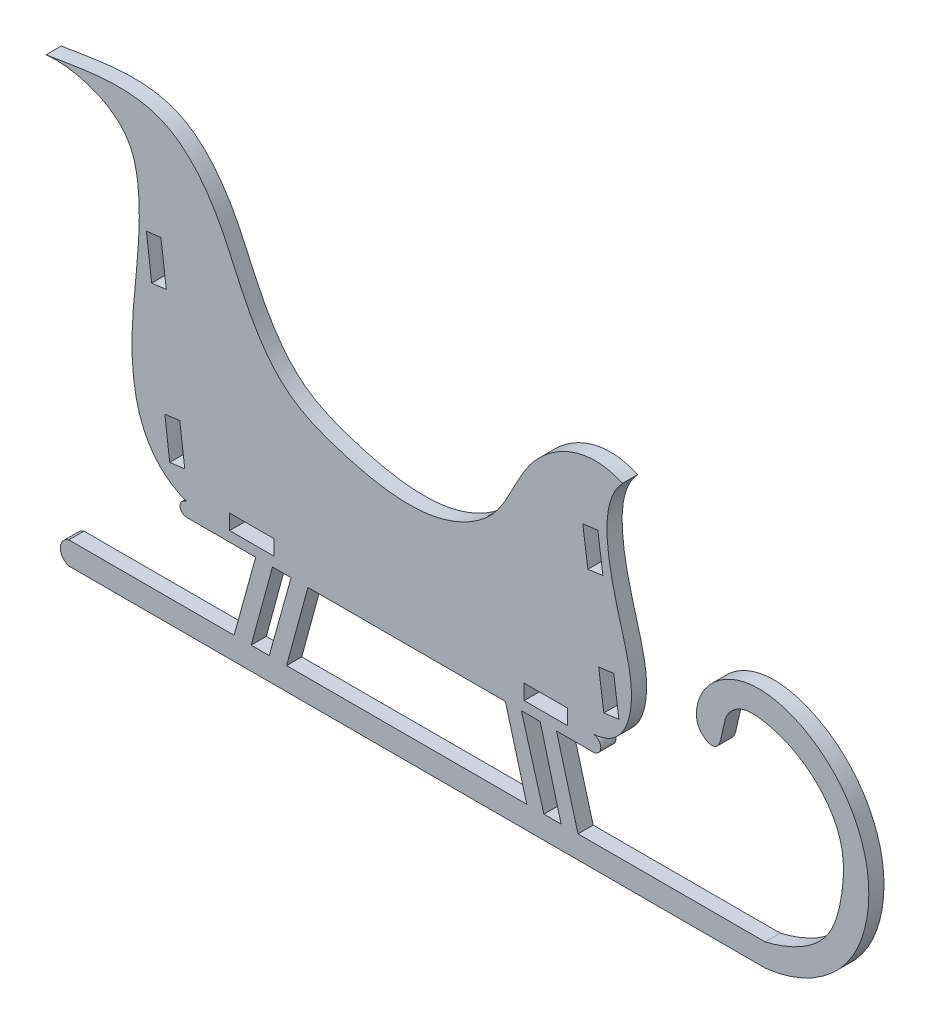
ISO-10303-21;
HEADER;
FILE_DESCRIPTION(('STEP AP214'),'2;1');
FILE_NAME('part.step','',(''),(''),'','','');
FILE_SCHEMA(('AUTOMOTIVE_DESIGN { 1 0 10303 214 1 1 1 1 }'));
ENDSEC;
DATA;
#1=APPLICATION_CONTEXT('core data for automotive mechanical design processes');
#2=APPLICATION_PROTOCOL_DEFINITION('international standard','automotive_design',2000,#1);
#3=PRODUCT_CONTEXT('',#1,'mechanical');
#4=PRODUCT('Part','Part','',(#3));
#5=PRODUCT_RELATED_PRODUCT_CATEGORY('part','',(#4));
#6=PRODUCT_DEFINITION_FORMATION('','',#4);
#7=PRODUCT_DEFINITION_CONTEXT('part definition',#1,'design');
#8=PRODUCT_DEFINITION('design','',#6,#7);
#9=PRODUCT_DEFINITION_SHAPE('','',#8);
#10=(LENGTH_UNIT() NAMED_UNIT(*) SI_UNIT(.MILLI.,.METRE.));
#11=(NAMED_UNIT(*) PLANE_ANGLE_UNIT() SI_UNIT($,.RADIAN.));
#12=(NAMED_UNIT(*) SI_UNIT($,.STERADIAN.) SOLID_ANGLE_UNIT());
#13=UNCERTAINTY_MEASURE_WITH_UNIT(LENGTH_MEASURE(1.E-05),#10,'distance_accuracy_value','');
#14=(GEOMETRIC_REPRESENTATION_CONTEXT(3) GLOBAL_UNCERTAINTY_ASSIGNED_CONTEXT((#13)) GLOBAL_UNIT_ASSIGNED_CONTEXT((#10,
#11,#12)) REPRESENTATION_CONTEXT('',''));
#15=CARTESIAN_POINT('',(0.,0.,0.));
#16=DIRECTION('',(0.,0.,1.));
#17=DIRECTION('',(1.,0.,0.));
#18=AXIS2_PLACEMENT_3D('',#15,#16,#17);
#19=CARTESIAN_POINT('',(-83.5191306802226,-58.7884222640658,3.));
#20=DIRECTION('',(0.,0.,1.));
#21=DIRECTION('',(1.,0.,0.));
#22=AXIS2_PLACEMENT_3D('',#19,#20,#21);
#23=PLANE('',#22);
#24=DIRECTION('',(0.122452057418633,-0.992474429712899,0.));
#25=VECTOR('',#24,1.);
#26=CARTESIAN_POINT('',(-68.811015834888,4.06650200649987,3.));
#27=LINE('',#26,#25);
#28=CARTESIAN_POINT('',(-68.811015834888,4.06650200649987,3.));
#29=VERTEX_POINT('',#28);
#30=CARTESIAN_POINT('',(-67.7747054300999,-4.3327980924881,3.));
#31=VERTEX_POINT('',#30);
#32=EDGE_CURVE('E388',#29,#31,#27,.T.);
#33=ORIENTED_EDGE('',*,*,#32,.F.);
#34=DIRECTION('',(-0.992474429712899,-0.122452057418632,0.));
#35=VECTOR('',#34,1.);
#36=CARTESIAN_POINT('',(-68.811015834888,4.06650200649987,3.));
#37=LINE('',#36,#35);
#38=CARTESIAN_POINT('',(-65.9380924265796,4.42096492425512,3.));
#39=VERTEX_POINT('',#38);
#40=EDGE_CURVE('E386',#39,#29,#37,.T.);
#41=ORIENTED_EDGE('',*,*,#40,.F.);
#42=DIRECTION('',(-0.125229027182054,0.992127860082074,0.));
#43=VECTOR('',#42,1.);
#44=CARTESIAN_POINT('',(-65.9380924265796,4.42096492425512,3.));
#45=LINE('',#44,#43);
#46=CARTESIAN_POINT('',(-64.8782764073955,-3.9754350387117,3.));
#47=VERTEX_POINT('',#46);
#48=EDGE_CURVE('E394',#47,#39,#45,.T.);
#49=ORIENTED_EDGE('',*,*,#48,.F.);
#50=DIRECTION('',(0.992474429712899,0.122452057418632,0.));
#51=VECTOR('',#50,1.);
#52=CARTESIAN_POINT('',(-67.7747054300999,-4.3327980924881,3.));
#53=LINE('',#52,#51);
#54=EDGE_CURVE('E391',#31,#47,#53,.T.);
#55=ORIENTED_EDGE('',*,*,#54,.F.);
#56=EDGE_LOOP('',(#33,#41,#49,#55));
#57=FACE_BOUND('',#56,.T.);
#58=DIRECTION('',(0.135947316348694,-0.990716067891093,0.));
#59=VECTOR('',#58,1.);
#60=CARTESIAN_POINT('',(17.5671562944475,-2.92760707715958,3.));
#61=LINE('',#60,#59);
#62=CARTESIAN_POINT('',(17.5671562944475,-2.92760707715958,3.));
#63=VERTEX_POINT('',#62);
#64=CARTESIAN_POINT('',(18.5676410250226,-10.2186395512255,3.));
#65=VERTEX_POINT('',#64);
#66=EDGE_CURVE('E450',#63,#65,#61,.T.);
#67=ORIENTED_EDGE('',*,*,#66,.F.);
#68=DIRECTION('',(-0.990716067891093,-0.135947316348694,0.));
#69=VECTOR('',#68,1.);
#70=CARTESIAN_POINT('',(20.5393044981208,-2.5197651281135,3.));
#71=LINE('',#70,#69);
#72=CARTESIAN_POINT('',(20.5393044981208,-2.5197651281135,3.));
#73=VERTEX_POINT('',#72);
#74=EDGE_CURVE('E448',#73,#63,#71,.T.);
#75=ORIENTED_EDGE('',*,*,#74,.F.);
#76=DIRECTION('',(-0.135947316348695,0.990716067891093,0.));
#77=VECTOR('',#76,1.);
#78=CARTESIAN_POINT('',(20.5393044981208,-2.5197651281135,3.));
#79=LINE('',#78,#77);
#80=CARTESIAN_POINT('',(21.5397892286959,-9.81079760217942,3.));
#81=VERTEX_POINT('',#80);
#82=EDGE_CURVE('E456',#81,#73,#79,.T.);
#83=ORIENTED_EDGE('',*,*,#82,.F.);
#84=DIRECTION('',(0.990716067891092,0.135947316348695,0.));
#85=VECTOR('',#84,1.);
#86=CARTESIAN_POINT('',(21.5397892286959,-9.81079760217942,3.));
#87=LINE('',#86,#85);
#88=EDGE_CURVE('E453',#65,#81,#87,.T.);
#89=ORIENTED_EDGE('',*,*,#88,.F.);
#90=EDGE_LOOP('',(#67,#75,#83,#89));
#91=FACE_BOUND('',#90,.T.);
#92=DIRECTION('',(1.,0.,0.));
#93=VECTOR('',#92,1.);
#94=CARTESIAN_POINT('',(-52.3332008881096,-39.03705505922,3.));
#95=LINE('',#94,#93);
#96=CARTESIAN_POINT('',(-52.3332008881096,-39.03705505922,3.));
#97=VERTEX_POINT('',#96);
#98=CARTESIAN_POINT('',(-43.6048370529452,-39.03705505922,3.));
#99=VERTEX_POINT('',#98);
#100=EDGE_CURVE('E512',#97,#99,#95,.T.);
#101=ORIENTED_EDGE('',*,*,#100,.F.);
#102=DIRECTION('',(0.,-1.,0.));
#103=VECTOR('',#102,1.);
#104=CARTESIAN_POINT('',(-52.3332008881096,-36.03705505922,3.));
#105=LINE('',#104,#103);
#106=CARTESIAN_POINT('',(-52.3332008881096,-36.03705505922,3.));
#107=VERTEX_POINT('',#106);
#108=EDGE_CURVE('E510',#107,#97,#105,.T.);
#109=ORIENTED_EDGE('',*,*,#108,.F.);
#110=DIRECTION('',(-1.,0.,0.));
#111=VECTOR('',#110,1.);
#112=CARTESIAN_POINT('',(-52.3332008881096,-36.03705505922,3.));
#113=LINE('',#112,#111);
#114=CARTESIAN_POINT('',(-43.6048370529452,-36.03705505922,3.));
#115=VERTEX_POINT('',#114);
#116=EDGE_CURVE('E518',#115,#107,#113,.T.);
#117=ORIENTED_EDGE('',*,*,#116,.F.);
#118=DIRECTION('',(0.,1.,0.));
#119=VECTOR('',#118,1.);
#120=CARTESIAN_POINT('',(-43.6048370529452,-36.03705505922,3.));
#121=LINE('',#120,#119);
#122=EDGE_CURVE('E515',#99,#115,#121,.T.);
#123=ORIENTED_EDGE('',*,*,#122,.F.);
#124=EDGE_LOOP('',(#101,#109,#117,#123));
#125=FACE_BOUND('',#124,.T.);
#126=DIRECTION('',(-0.262879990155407,-0.964828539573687,0.));
#127=VECTOR('',#126,1.);
#128=CARTESIAN_POINT('',(-36.8429606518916,-41.0336037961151,3.));
#129=LINE('',#128,#127);
#130=CARTESIAN_POINT('',(-36.8429606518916,-41.0336037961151,3.));
#131=VERTEX_POINT('',#130);
#132=CARTESIAN_POINT('',(-41.069638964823,-56.5464614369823,3.));
#133=VERTEX_POINT('',#132);
#134=EDGE_CURVE('E574',#131,#133,#129,.T.);
#135=ORIENTED_EDGE('',*,*,#134,.F.);
#136=DIRECTION('',(-1.,0.,0.));
#137=VECTOR('',#136,1.);
#138=CARTESIAN_POINT('',(-36.8429606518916,-41.0336037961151,3.));
#139=LINE('',#138,#137);
#140=CARTESIAN_POINT('',(2.24861158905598,-41.0336037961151,3.));
#141=VERTEX_POINT('',#140);
#142=EDGE_CURVE('E572',#141,#131,#139,.T.);
#143=ORIENTED_EDGE('',*,*,#142,.F.);
#144=DIRECTION('',(-0.263107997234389,0.96476638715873,0.));
#145=VECTOR('',#144,1.);
#146=CARTESIAN_POINT('',(2.24861158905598,-41.0336037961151,3.));
#147=LINE('',#146,#145);
#148=CARTESIAN_POINT('',(6.4792284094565,-56.5464614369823,3.));
#149=VERTEX_POINT('',#148);
#150=EDGE_CURVE('E580',#149,#141,#147,.T.);
#151=ORIENTED_EDGE('',*,*,#150,.F.);
#152=DIRECTION('',(1.,0.,0.));
#153=VECTOR('',#152,1.);
#154=CARTESIAN_POINT('',(-41.069638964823,-56.5464614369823,3.));
#155=LINE('',#154,#153);
#156=EDGE_CURVE('E577',#133,#149,#155,.T.);
#157=ORIENTED_EDGE('',*,*,#156,.F.);
#158=EDGE_LOOP('',(#135,#143,#151,#157));
#159=FACE_BOUND('',#158,.T.);
#160=CARTESIAN_POINT('',(-83.5191306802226,-58.7884222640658,3.));
#161=DIRECTION('',(0.,0.,1.));
#162=DIRECTION('',(1.,0.,0.));
#163=AXIS2_PLACEMENT_3D('',#160,#161,#162);
#164=CIRCLE('',#163,2.33727330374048);
#165=CARTESIAN_POINT('',(-84.1797804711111,-56.5464614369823,3.));
#166=VERTEX_POINT('',#165);
#167=CARTESIAN_POINT('',(-84.1797804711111,-61.0303830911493,3.));
#168=VERTEX_POINT('',#167);
#169=EDGE_CURVE('E634',#166,#168,#164,.T.);
#170=ORIENTED_EDGE('',*,*,#169,.T.);
#171=DIRECTION('',(1.,0.,0.));
#172=VECTOR('',#171,1.);
#173=CARTESIAN_POINT('',(-84.1797804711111,-61.0303830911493,3.));
#174=LINE('',#173,#172);
#175=CARTESIAN_POINT('',(53.6472172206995,-61.0303830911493,3.));
#176=VERTEX_POINT('',#175);
#177=EDGE_CURVE('E637',#168,#176,#174,.T.);
#178=ORIENTED_EDGE('',*,*,#177,.T.);
#179=CARTESIAN_POINT('',(53.6472172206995,-61.0303830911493,3.));
#180=CARTESIAN_POINT('',(59.9291947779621,-60.4336448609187,3.));
#181=CARTESIAN_POINT('',(69.3823626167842,-55.383789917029,3.));
#182=CARTESIAN_POINT('',(74.4178193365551,-42.8254598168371,3.));
#183=CARTESIAN_POINT('',(74.3117104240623,-32.3380007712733,3.));
#184=CARTESIAN_POINT('',(69.7532954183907,-22.463433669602,3.));
#185=CARTESIAN_POINT('',(61.4335084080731,-15.2394192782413,3.));
#186=CARTESIAN_POINT('',(50.9900129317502,-12.599334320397,3.));
#187=CARTESIAN_POINT('',(42.6828126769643,-16.7575625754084,3.));
#188=CARTESIAN_POINT('',(39.7317831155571,-22.5054934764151,3.));
#189=CARTESIAN_POINT('',(40.2430388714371,-27.0275203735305,3.));
#190=CARTESIAN_POINT('',(44.0032322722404,-28.9565452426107,3.));
#191=CARTESIAN_POINT('',(45.3999353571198,-24.9389240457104,3.));
#192=CARTESIAN_POINT('',(45.475828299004,-21.6745456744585,3.));
#193=CARTESIAN_POINT('',(48.8553465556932,-18.359931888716,3.));
#194=CARTESIAN_POINT('',(55.5498279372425,-18.8283476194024,3.));
#195=CARTESIAN_POINT('',(63.3590647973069,-22.5492054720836,3.));
#196=CARTESIAN_POINT('',(69.5542887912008,-31.213460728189,3.));
#197=CARTESIAN_POINT('',(69.1493679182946,-40.8991370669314,3.));
#198=CARTESIAN_POINT('',(66.2346143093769,-51.8434706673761,3.));
#199=CARTESIAN_POINT('',(58.0533571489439,-55.5046807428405,3.));
#200=CARTESIAN_POINT('',(53.6472172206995,-56.5464614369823,3.));
#201=B_SPLINE_CURVE_WITH_KNOTS('',3,(#179,#180,#181,#182,#183,#184,#185,#186,#187,#188,#189,
#190,#191,#192,#193,#194,#195,#196,#197,#198,#199,#200),.UNSPECIFIED.,.F.,.F.,(4,1,1,1,1,1,1,1,
1,1,1,1,1,1,1,1,1,1,1,4),(0.,0.118318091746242,0.178696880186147,0.243896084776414,
0.308628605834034,0.375018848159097,0.444252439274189,0.495080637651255,0.53592759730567,
0.556482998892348,0.575284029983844,0.59181337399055,0.619800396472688,0.638937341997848,
0.671645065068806,0.735613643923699,0.797776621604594,0.855999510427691,0.911224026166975,1.),.UNSPECIFIED.);
#202=CARTESIAN_POINT('',(53.6472172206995,-56.5464614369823,3.));
#203=VERTEX_POINT('',#202);
#204=EDGE_CURVE('E640',#176,#203,#201,.T.);
#205=ORIENTED_EDGE('',*,*,#204,.T.);
#206=DIRECTION('',(-1.,0.,0.));
#207=VECTOR('',#206,1.);
#208=CARTESIAN_POINT('',(16.6192782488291,-56.5464614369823,3.));
#209=LINE('',#208,#207);
#210=CARTESIAN_POINT('',(16.6192782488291,-56.5464614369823,3.));
#211=VERTEX_POINT('',#210);
#212=EDGE_CURVE('E645',#203,#211,#209,.T.);
#213=ORIENTED_EDGE('',*,*,#212,.T.);
#214=DIRECTION('',(-0.265049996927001,0.964234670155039,0.));
#215=VECTOR('',#214,1.);
#216=CARTESIAN_POINT('',(12.3550851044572,-41.0336037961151,3.));
#217=LINE('',#216,#215);
#218=CARTESIAN_POINT('',(12.3550851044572,-41.0336037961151,3.));
#219=VERTEX_POINT('',#218);
#220=EDGE_CURVE('E824',#211,#219,#217,.T.);
#221=ORIENTED_EDGE('',*,*,#220,.T.);
#222=DIRECTION('',(1.,0.,0.));
#223=VECTOR('',#222,1.);
#224=CARTESIAN_POINT('',(12.3550851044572,-41.0336037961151,3.));
#225=LINE('',#224,#223);
#226=CARTESIAN_POINT('',(19.5805575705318,-41.0336037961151,3.));
#227=VERTEX_POINT('',#226);
#228=EDGE_CURVE('E827',#219,#227,#225,.T.);
#229=ORIENTED_EDGE('',*,*,#228,.T.);
#230=CARTESIAN_POINT('',(19.5805575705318,-39.4875745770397,3.));
#231=DIRECTION('',(0.,0.,1.));
#232=DIRECTION('',(-1.,0.,0.));
#233=AXIS2_PLACEMENT_3D('',#230,#231,#232);
#234=CIRCLE('',#233,1.54602921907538);
#235=CARTESIAN_POINT('',(19.5805575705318,-37.9415453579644,3.));
#236=VERTEX_POINT('',#235);
#237=EDGE_CURVE('E828',#227,#236,#234,.T.);
#238=ORIENTED_EDGE('',*,*,#237,.T.);
#239=CARTESIAN_POINT('',(19.5805575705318,-37.9415453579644,3.));
#240=CARTESIAN_POINT('',(25.2299828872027,-37.5868787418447,3.));
#241=CARTESIAN_POINT('',(28.4775733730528,-28.8606097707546,3.));
#242=CARTESIAN_POINT('',(25.1499116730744,-16.5518720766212,3.));
#243=CARTESIAN_POINT('',(21.724585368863,-4.70684855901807,3.));
#244=CARTESIAN_POINT('',(22.4208131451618,4.69739300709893,3.));
#245=CARTESIAN_POINT('',(25.4417101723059,7.95109431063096,3.));
#246=B_SPLINE_CURVE_WITH_KNOTS('',3,(#239,#240,#241,#242,#243,#244,#245),.UNSPECIFIED.,.F.,.F.,
(4,1,1,1,4),(0.,0.267071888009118,0.473773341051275,0.751201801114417,1.),.UNSPECIFIED.);
#247=CARTESIAN_POINT('',(25.4417101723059,7.95109431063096,3.));
#248=VERTEX_POINT('',#247);
#249=EDGE_CURVE('E831',#236,#248,#246,.T.);
#250=ORIENTED_EDGE('',*,*,#249,.T.);
#251=CARTESIAN_POINT('',(25.4417101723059,7.95109431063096,3.));
#252=CARTESIAN_POINT('',(18.2394744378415,11.1790858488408,3.));
#253=CARTESIAN_POINT('',(6.33555793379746,4.88697207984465,3.));
#254=CARTESIAN_POINT('',(1.63752162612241,-10.574531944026,3.));
#255=CARTESIAN_POINT('',(-12.6339474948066,-18.3947780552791,3.));
#256=CARTESIAN_POINT('',(-27.4374273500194,-15.8032645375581,3.));
#257=CARTESIAN_POINT('',(-41.7432465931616,-10.4870441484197,3.));
#258=CARTESIAN_POINT('',(-50.0001166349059,2.00937984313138,3.));
#259=CARTESIAN_POINT('',(-54.5289932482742,15.1780592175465,3.));
#260=CARTESIAN_POINT('',(-67.5421382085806,28.7125496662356,3.));
#261=CARTESIAN_POINT('',(-81.5316472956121,25.4349777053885,3.));
#262=CARTESIAN_POINT('',(-88.6858903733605,24.3603511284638,3.));
#263=B_SPLINE_CURVE_WITH_KNOTS('',3,(#251,#252,#253,#254,#255,#256,#257,#258,#259,#260,#261,
#262),.UNSPECIFIED.,.F.,.F.,(4,1,1,1,1,1,1,1,1,4),(0.,0.145272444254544,0.238173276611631,
0.322903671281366,0.456838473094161,0.539754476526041,0.633484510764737,0.754414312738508,
0.833695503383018,1.),.UNSPECIFIED.);
#264=CARTESIAN_POINT('',(-88.6858903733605,24.3603511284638,3.));
#265=VERTEX_POINT('',#264);
#266=EDGE_CURVE('E709',#248,#265,#263,.T.);
#267=ORIENTED_EDGE('',*,*,#266,.T.);
#268=CARTESIAN_POINT('',(-88.6858903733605,24.3603511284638,3.));
#269=CARTESIAN_POINT('',(-83.396842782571,24.9563154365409,3.));
#270=CARTESIAN_POINT('',(-71.9174210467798,21.8370688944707,3.));
#271=CARTESIAN_POINT('',(-69.1710627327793,3.38628081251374,3.));
#272=CARTESIAN_POINT('',(-73.3960238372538,-15.596063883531,3.));
#273=CARTESIAN_POINT('',(-70.0486208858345,-34.7976680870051,3.));
#274=CARTESIAN_POINT('',(-60.8201349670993,-38.3546358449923,3.));
#275=B_SPLINE_CURVE_WITH_KNOTS('',3,(#268,#269,#270,#271,#272,#273,#274),.UNSPECIFIED.,.F.,.F.,
(4,1,1,1,4),(0.,0.226946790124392,0.344563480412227,0.66634673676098,1.),.UNSPECIFIED.);
#276=CARTESIAN_POINT('',(-60.8201349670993,-38.3546358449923,3.));
#277=VERTEX_POINT('',#276);
#278=EDGE_CURVE('E703',#265,#277,#275,.T.);
#279=ORIENTED_EDGE('',*,*,#278,.T.);
#280=CARTESIAN_POINT('',(-60.8201349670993,-39.6941198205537,3.));
#281=DIRECTION('',(0.,0.,1.));
#282=DIRECTION('',(1.,0.,0.));
#283=AXIS2_PLACEMENT_3D('',#280,#281,#282);
#284=CIRCLE('',#283,1.33948397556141);
#285=CARTESIAN_POINT('',(-60.8201349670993,-41.0336037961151,3.));
#286=VERTEX_POINT('',#285);
#287=EDGE_CURVE('E708',#277,#286,#284,.T.);
#288=ORIENTED_EDGE('',*,*,#287,.T.);
#289=DIRECTION('',(1.,0.,0.));
#290=VECTOR('',#289,1.);
#291=CARTESIAN_POINT('',(-60.8201349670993,-41.0336037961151,3.));
#292=LINE('',#291,#290);
#293=CARTESIAN_POINT('',(-47.1858911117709,-41.0336037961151,3.));
#294=VERTEX_POINT('',#293);
#295=EDGE_CURVE('E718',#286,#294,#292,.T.);
#296=ORIENTED_EDGE('',*,*,#295,.T.);
#297=DIRECTION('',(-0.265755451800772,-0.964040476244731,0.));
#298=VECTOR('',#297,1.);
#299=CARTESIAN_POINT('',(-47.1858911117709,-41.0336037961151,3.));
#300=LINE('',#299,#298);
#301=CARTESIAN_POINT('',(-51.4622950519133,-56.5464614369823,3.));
#302=VERTEX_POINT('',#301);
#303=EDGE_CURVE('E720',#294,#302,#300,.T.);
#304=ORIENTED_EDGE('',*,*,#303,.T.);
#305=DIRECTION('',(-1.,0.,0.));
#306=VECTOR('',#305,1.);
#307=CARTESIAN_POINT('',(-84.1797804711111,-56.5464614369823,3.));
#308=LINE('',#307,#306);
#309=EDGE_CURVE('E722',#302,#166,#308,.T.);
#310=ORIENTED_EDGE('',*,*,#309,.T.);
#311=EDGE_LOOP('',(#170,#178,#205,#213,#221,#229,#238,#250,#267,#279,#288,#296,#304,#310));
#312=FACE_BOUND('',#311,.T.);
#313=DIRECTION('',(-0.262879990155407,-0.964828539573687,0.));
#314=VECTOR('',#313,1.);
#315=CARTESIAN_POINT('',(-43.8542740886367,-41.0336037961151,3.));
#316=LINE('',#315,#314);
#317=CARTESIAN_POINT('',(-43.8542740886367,-41.0336037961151,3.));
#318=VERTEX_POINT('',#317);
#319=CARTESIAN_POINT('',(-48.0809524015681,-56.5464614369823,3.));
#320=VERTEX_POINT('',#319);
#321=EDGE_CURVE('E605',#318,#320,#316,.T.);
#322=ORIENTED_EDGE('',*,*,#321,.F.);
#323=DIRECTION('',(-1.,0.,0.));
#324=VECTOR('',#323,1.);
#325=CARTESIAN_POINT('',(-43.8542740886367,-41.0336037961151,3.));
#326=LINE('',#325,#324);
#327=CARTESIAN_POINT('',(-40.1745776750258,-41.0336037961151,3.));
#328=VERTEX_POINT('',#327);
#329=EDGE_CURVE('E603',#328,#318,#326,.T.);
#330=ORIENTED_EDGE('',*,*,#329,.F.);
#331=DIRECTION('',(0.26862383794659,0.963245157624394,0.));
#332=VECTOR('',#331,1.);
#333=CARTESIAN_POINT('',(-40.1745776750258,-41.0336037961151,3.));
#334=LINE('',#333,#332);
#335=CARTESIAN_POINT('',(-44.5007072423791,-56.5464614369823,3.));
#336=VERTEX_POINT('',#335);
#337=EDGE_CURVE('E611',#336,#328,#334,.T.);
#338=ORIENTED_EDGE('',*,*,#337,.F.);
#339=DIRECTION('',(1.,0.,0.));
#340=VECTOR('',#339,1.);
#341=CARTESIAN_POINT('',(-48.0809524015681,-56.5464614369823,3.));
#342=LINE('',#341,#340);
#343=EDGE_CURVE('E608',#320,#336,#342,.T.);
#344=ORIENTED_EDGE('',*,*,#343,.F.);
#345=EDGE_LOOP('',(#322,#330,#338,#344));
#346=FACE_BOUND('',#345,.T.);
#347=DIRECTION('',(0.276633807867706,-0.960975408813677,0.));
#348=VECTOR('',#347,1.);
#349=CARTESIAN_POINT('',(5.40478604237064,-41.0336037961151,3.));
#350=LINE('',#349,#348);
#351=CARTESIAN_POINT('',(5.40478604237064,-41.0336037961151,3.));
#352=VERTEX_POINT('',#351);
#353=CARTESIAN_POINT('',(9.87043713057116,-56.5464614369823,3.));
#354=VERTEX_POINT('',#353);
#355=EDGE_CURVE('E543',#352,#354,#350,.T.);
#356=ORIENTED_EDGE('',*,*,#355,.F.);
#357=DIRECTION('',(-1.,0.,0.));
#358=VECTOR('',#357,1.);
#359=CARTESIAN_POINT('',(5.40478604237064,-41.0336037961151,3.));
#360=LINE('',#359,#358);
#361=CARTESIAN_POINT('',(9.13175800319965,-41.0336037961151,3.));
#362=VERTEX_POINT('',#361);
#363=EDGE_CURVE('E541',#362,#352,#360,.T.);
#364=ORIENTED_EDGE('',*,*,#363,.F.);
#365=DIRECTION('',(-0.257262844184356,0.966341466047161,0.));
#366=VECTOR('',#365,1.);
#367=CARTESIAN_POINT('',(9.13175800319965,-41.0336037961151,3.));
#368=LINE('',#367,#366);
#369=CARTESIAN_POINT('',(13.2616458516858,-56.5464614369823,3.));
#370=VERTEX_POINT('',#369);
#371=EDGE_CURVE('E549',#370,#362,#368,.T.);
#372=ORIENTED_EDGE('',*,*,#371,.F.);
#373=DIRECTION('',(1.,0.,0.));
#374=VECTOR('',#373,1.);
#375=CARTESIAN_POINT('',(9.87043713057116,-56.5464614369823,3.));
#376=LINE('',#375,#374);
#377=EDGE_CURVE('E546',#354,#370,#376,.T.);
#378=ORIENTED_EDGE('',*,*,#377,.F.);
#379=EDGE_LOOP('',(#356,#364,#372,#378));
#380=FACE_BOUND('',#379,.T.);
#381=DIRECTION('',(1.,0.,0.));
#382=VECTOR('',#381,1.);
#383=CARTESIAN_POINT('',(5.96066823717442,-39.03705505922,3.));
#384=LINE('',#383,#382);
#385=CARTESIAN_POINT('',(5.96066823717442,-39.03705505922,3.));
#386=VERTEX_POINT('',#385);
#387=CARTESIAN_POINT('',(14.5842551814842,-39.03705505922,3.));
#388=VERTEX_POINT('',#387);
#389=EDGE_CURVE('E481',#386,#388,#384,.T.);
#390=ORIENTED_EDGE('',*,*,#389,.F.);
#391=DIRECTION('',(0.,-1.,0.));
#392=VECTOR('',#391,1.);
#393=CARTESIAN_POINT('',(5.96066823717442,-39.03705505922,3.));
#394=LINE('',#393,#392);
#395=CARTESIAN_POINT('',(5.96066823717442,-36.03705505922,3.));
#396=VERTEX_POINT('',#395);
#397=EDGE_CURVE('E479',#396,#386,#394,.T.);
#398=ORIENTED_EDGE('',*,*,#397,.F.);
#399=DIRECTION('',(-1.,0.,0.));
#400=VECTOR('',#399,1.);
#401=CARTESIAN_POINT('',(5.96066823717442,-36.03705505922,3.));
#402=LINE('',#401,#400);
#403=CARTESIAN_POINT('',(14.5842551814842,-36.03705505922,3.));
#404=VERTEX_POINT('',#403);
#405=EDGE_CURVE('E487',#404,#396,#402,.T.);
#406=ORIENTED_EDGE('',*,*,#405,.F.);
#407=DIRECTION('',(0.,1.,0.));
#408=VECTOR('',#407,1.);
#409=CARTESIAN_POINT('',(14.5842551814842,-39.03705505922,3.));
#410=LINE('',#409,#408);
#411=EDGE_CURVE('E484',#388,#404,#410,.T.);
#412=ORIENTED_EDGE('',*,*,#411,.F.);
#413=EDGE_LOOP('',(#390,#398,#406,#412));
#414=FACE_BOUND('',#413,.T.);
#415=DIRECTION('',(-0.990716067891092,-0.135947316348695,0.));
#416=VECTOR('',#415,1.);
#417=CARTESIAN_POINT('',(23.6912324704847,-25.4894402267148,3.));
#418=LINE('',#417,#416);
#419=CARTESIAN_POINT('',(23.6912324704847,-25.4894402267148,3.));
#420=VERTEX_POINT('',#419);
#421=CARTESIAN_POINT('',(20.7190842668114,-25.8972821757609,3.));
#422=VERTEX_POINT('',#421);
#423=EDGE_CURVE('E419',#420,#422,#418,.T.);
#424=ORIENTED_EDGE('',*,*,#423,.F.);
#425=DIRECTION('',(-0.135947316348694,0.990716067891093,0.));
#426=VECTOR('',#425,1.);
#427=CARTESIAN_POINT('',(23.6912324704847,-25.4894402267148,3.));
#428=LINE('',#427,#426);
#429=CARTESIAN_POINT('',(24.7035592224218,-32.866771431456,3.));
#430=VERTEX_POINT('',#429);
#431=EDGE_CURVE('E417',#430,#420,#428,.T.);
#432=ORIENTED_EDGE('',*,*,#431,.F.);
#433=DIRECTION('',(0.990716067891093,0.135947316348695,0.));
#434=VECTOR('',#433,1.);
#435=CARTESIAN_POINT('',(21.7314110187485,-33.2746133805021,3.));
#436=LINE('',#435,#434);
#437=CARTESIAN_POINT('',(21.7314110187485,-33.2746133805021,3.));
#438=VERTEX_POINT('',#437);
#439=EDGE_CURVE('E425',#438,#430,#436,.T.);
#440=ORIENTED_EDGE('',*,*,#439,.F.);
#441=DIRECTION('',(0.135947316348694,-0.990716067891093,0.));
#442=VECTOR('',#441,1.);
#443=CARTESIAN_POINT('',(20.7190842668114,-25.8972821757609,3.));
#444=LINE('',#443,#442);
#445=EDGE_CURVE('E422',#422,#438,#444,.T.);
#446=ORIENTED_EDGE('',*,*,#445,.F.);
#447=EDGE_LOOP('',(#424,#432,#440,#446));
#448=FACE_BOUND('',#447,.T.);
#449=DIRECTION('',(0.992474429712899,0.122452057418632,0.));
#450=VECTOR('',#449,1.);
#451=CARTESIAN_POINT('',(-64.2038478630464,-33.2746133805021,3.));
#452=LINE('',#451,#450);
#453=CARTESIAN_POINT('',(-64.2038478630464,-33.2746133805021,3.));
#454=VERTEX_POINT('',#453);
#455=CARTESIAN_POINT('',(-61.2264245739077,-32.9072572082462,3.));
#456=VERTEX_POINT('',#455);
#457=EDGE_CURVE('E358',#454,#456,#452,.T.);
#458=ORIENTED_EDGE('',*,*,#457,.F.);
#459=DIRECTION('',(0.122452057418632,-0.992474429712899,0.));
#460=VECTOR('',#459,1.);
#461=CARTESIAN_POINT('',(-65.1643869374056,-25.4894402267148,3.));
#462=LINE('',#461,#460);
#463=CARTESIAN_POINT('',(-65.1643869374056,-25.4894402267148,3.));
#464=VERTEX_POINT('',#463);
#465=EDGE_CURVE('E350',#464,#454,#462,.T.);
#466=ORIENTED_EDGE('',*,*,#465,.F.);
#467=DIRECTION('',(-0.992127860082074,-0.125229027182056,0.));
#468=VECTOR('',#467,1.);
#469=CARTESIAN_POINT('',(-65.1643869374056,-25.4894402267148,3.));
#470=LINE('',#469,#468);
#471=CARTESIAN_POINT('',(-62.2097942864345,-25.1165036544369,3.));
#472=VERTEX_POINT('',#471);
#473=EDGE_CURVE('E372',#472,#464,#470,.T.);
#474=ORIENTED_EDGE('',*,*,#473,.F.);
#475=DIRECTION('',(-0.125229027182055,0.992127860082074,0.));
#476=VECTOR('',#475,1.);
#477=CARTESIAN_POINT('',(-62.2097942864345,-25.1165036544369,3.));
#478=LINE('',#477,#476);
#479=EDGE_CURVE('E370',#456,#472,#478,.T.);
#480=ORIENTED_EDGE('',*,*,#479,.F.);
#481=EDGE_LOOP('',(#458,#466,#474,#480));
#482=FACE_BOUND('',#481,.T.);
#483=ADVANCED_FACE('F33',(#57,#91,#125,#159,#312,#346,#380,#414,#448,#482),#23,.T.);
#484=CARTESIAN_POINT('',(-83.5191306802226,-58.7884222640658,0.));
#485=DIRECTION('',(0.,0.,1.));
#486=DIRECTION('',(1.,0.,0.));
#487=AXIS2_PLACEMENT_3D('',#484,#485,#486);
#488=PLANE('',#487);
#489=DIRECTION('',(-0.992474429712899,-0.122452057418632,0.));
#490=VECTOR('',#489,1.);
#491=CARTESIAN_POINT('',(-68.811015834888,4.06650200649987,0.));
#492=LINE('',#491,#490);
#493=CARTESIAN_POINT('',(-65.9380924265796,4.42096492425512,0.));
#494=VERTEX_POINT('',#493);
#495=CARTESIAN_POINT('',(-68.811015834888,4.06650200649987,0.));
#496=VERTEX_POINT('',#495);
#497=EDGE_CURVE('E366',#494,#496,#492,.T.);
#498=ORIENTED_EDGE('',*,*,#497,.T.);
#499=DIRECTION('',(0.122452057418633,-0.992474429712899,0.));
#500=VECTOR('',#499,1.);
#501=CARTESIAN_POINT('',(-68.811015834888,4.06650200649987,0.));
#502=LINE('',#501,#500);
#503=CARTESIAN_POINT('',(-67.7747054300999,-4.3327980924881,0.));
#504=VERTEX_POINT('',#503);
#505=EDGE_CURVE('E399',#496,#504,#502,.T.);
#506=ORIENTED_EDGE('',*,*,#505,.T.);
#507=DIRECTION('',(0.992474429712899,0.122452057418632,0.));
#508=VECTOR('',#507,1.);
#509=CARTESIAN_POINT('',(-67.7747054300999,-4.3327980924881,0.));
#510=LINE('',#509,#508);
#511=CARTESIAN_POINT('',(-64.8782764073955,-3.9754350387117,0.));
#512=VERTEX_POINT('',#511);
#513=EDGE_CURVE('E402',#504,#512,#510,.T.);
#514=ORIENTED_EDGE('',*,*,#513,.T.);
#515=DIRECTION('',(-0.125229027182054,0.992127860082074,0.));
#516=VECTOR('',#515,1.);
#517=CARTESIAN_POINT('',(-65.9380924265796,4.42096492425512,0.));
#518=LINE('',#517,#516);
#519=EDGE_CURVE('E389',#512,#494,#518,.T.);
#520=ORIENTED_EDGE('',*,*,#519,.T.);
#521=EDGE_LOOP('',(#498,#506,#514,#520));
#522=FACE_BOUND('',#521,.T.);
#523=DIRECTION('',(-0.990716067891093,-0.135947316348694,0.));
#524=VECTOR('',#523,1.);
#525=CARTESIAN_POINT('',(20.5393044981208,-2.5197651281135,0.));
#526=LINE('',#525,#524);
#527=CARTESIAN_POINT('',(20.5393044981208,-2.51976512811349,0.));
#528=VERTEX_POINT('',#527);
#529=CARTESIAN_POINT('',(17.5671562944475,-2.92760707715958,0.));
#530=VERTEX_POINT('',#529);
#531=EDGE_CURVE('E447',#528,#530,#526,.T.);
#532=ORIENTED_EDGE('',*,*,#531,.T.);
#533=DIRECTION('',(0.135947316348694,-0.990716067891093,0.));
#534=VECTOR('',#533,1.);
#535=CARTESIAN_POINT('',(17.5671562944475,-2.92760707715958,0.));
#536=LINE('',#535,#534);
#537=CARTESIAN_POINT('',(18.5676410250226,-10.2186395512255,0.));
#538=VERTEX_POINT('',#537);
#539=EDGE_CURVE('E461',#530,#538,#536,.T.);
#540=ORIENTED_EDGE('',*,*,#539,.T.);
#541=DIRECTION('',(0.990716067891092,0.135947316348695,0.));
#542=VECTOR('',#541,1.);
#543=CARTESIAN_POINT('',(21.5397892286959,-9.81079760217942,0.));
#544=LINE('',#543,#542);
#545=CARTESIAN_POINT('',(21.5397892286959,-9.81079760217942,0.));
#546=VERTEX_POINT('',#545);
#547=EDGE_CURVE('E464',#538,#546,#544,.T.);
#548=ORIENTED_EDGE('',*,*,#547,.T.);
#549=DIRECTION('',(-0.135947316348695,0.990716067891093,0.));
#550=VECTOR('',#549,1.);
#551=CARTESIAN_POINT('',(20.5393044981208,-2.5197651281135,0.));
#552=LINE('',#551,#550);
#553=EDGE_CURVE('E451',#546,#528,#552,.T.);
#554=ORIENTED_EDGE('',*,*,#553,.T.);
#555=EDGE_LOOP('',(#532,#540,#548,#554));
#556=FACE_BOUND('',#555,.T.);
#557=DIRECTION('',(0.,-1.,0.));
#558=VECTOR('',#557,1.);
#559=CARTESIAN_POINT('',(-52.3332008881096,-36.03705505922,0.));
#560=LINE('',#559,#558);
#561=CARTESIAN_POINT('',(-52.3332008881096,-36.03705505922,0.));
#562=VERTEX_POINT('',#561);
#563=CARTESIAN_POINT('',(-52.3332008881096,-39.03705505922,0.));
#564=VERTEX_POINT('',#563);
#565=EDGE_CURVE('E509',#562,#564,#560,.T.);
#566=ORIENTED_EDGE('',*,*,#565,.T.);
#567=DIRECTION('',(1.,0.,0.));
#568=VECTOR('',#567,1.);
#569=CARTESIAN_POINT('',(-52.3332008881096,-39.03705505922,0.));
#570=LINE('',#569,#568);
#571=CARTESIAN_POINT('',(-43.6048370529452,-39.03705505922,0.));
#572=VERTEX_POINT('',#571);
#573=EDGE_CURVE('E523',#564,#572,#570,.T.);
#574=ORIENTED_EDGE('',*,*,#573,.T.);
#575=DIRECTION('',(0.,1.,0.));
#576=VECTOR('',#575,1.);
#577=CARTESIAN_POINT('',(-43.6048370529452,-36.03705505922,0.));
#578=LINE('',#577,#576);
#579=CARTESIAN_POINT('',(-43.6048370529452,-36.03705505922,0.));
#580=VERTEX_POINT('',#579);
#581=EDGE_CURVE('E526',#572,#580,#578,.T.);
#582=ORIENTED_EDGE('',*,*,#581,.T.);
#583=DIRECTION('',(-1.,0.,0.));
#584=VECTOR('',#583,1.);
#585=CARTESIAN_POINT('',(-52.3332008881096,-36.03705505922,0.));
#586=LINE('',#585,#584);
#587=EDGE_CURVE('E513',#580,#562,#586,.T.);
#588=ORIENTED_EDGE('',*,*,#587,.T.);
#589=EDGE_LOOP('',(#566,#574,#582,#588));
#590=FACE_BOUND('',#589,.T.);
#591=DIRECTION('',(-1.,0.,0.));
#592=VECTOR('',#591,1.);
#593=CARTESIAN_POINT('',(-36.8429606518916,-41.0336037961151,0.));
#594=LINE('',#593,#592);
#595=CARTESIAN_POINT('',(2.248611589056,-41.0336037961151,0.));
#596=VERTEX_POINT('',#595);
#597=CARTESIAN_POINT('',(-36.8429606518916,-41.0336037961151,0.));
#598=VERTEX_POINT('',#597);
#599=EDGE_CURVE('E571',#596,#598,#594,.T.);
#600=ORIENTED_EDGE('',*,*,#599,.T.);
#601=DIRECTION('',(-0.262879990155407,-0.964828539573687,0.));
#602=VECTOR('',#601,1.);
#603=CARTESIAN_POINT('',(-36.8429606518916,-41.0336037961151,0.));
#604=LINE('',#603,#602);
#605=CARTESIAN_POINT('',(-41.069638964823,-56.5464614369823,0.));
#606=VERTEX_POINT('',#605);
#607=EDGE_CURVE('E585',#598,#606,#604,.T.);
#608=ORIENTED_EDGE('',*,*,#607,.T.);
#609=DIRECTION('',(1.,0.,0.));
#610=VECTOR('',#609,1.);
#611=CARTESIAN_POINT('',(-41.069638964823,-56.5464614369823,0.));
#612=LINE('',#611,#610);
#613=CARTESIAN_POINT('',(6.47922840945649,-56.5464614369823,0.));
#614=VERTEX_POINT('',#613);
#615=EDGE_CURVE('E588',#606,#614,#612,.T.);
#616=ORIENTED_EDGE('',*,*,#615,.T.);
#617=DIRECTION('',(-0.263107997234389,0.96476638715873,0.));
#618=VECTOR('',#617,1.);
#619=CARTESIAN_POINT('',(2.24861158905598,-41.0336037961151,0.));
#620=LINE('',#619,#618);
#621=EDGE_CURVE('E575',#614,#596,#620,.T.);
#622=ORIENTED_EDGE('',*,*,#621,.T.);
#623=EDGE_LOOP('',(#600,#608,#616,#622));
#624=FACE_BOUND('',#623,.T.);
#625=CARTESIAN_POINT('',(-83.5191306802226,-58.7884222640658,0.));
#626=DIRECTION('',(0.,0.,1.));
#627=DIRECTION('',(1.,0.,0.));
#628=AXIS2_PLACEMENT_3D('',#625,#626,#627);
#629=CIRCLE('',#628,2.33727330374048);
#630=CARTESIAN_POINT('',(-84.1797804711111,-56.5464614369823,0.));
#631=VERTEX_POINT('',#630);
#632=CARTESIAN_POINT('',(-84.1797804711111,-61.0303830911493,0.));
#633=VERTEX_POINT('',#632);
#634=EDGE_CURVE('E633',#631,#633,#629,.T.);
#635=ORIENTED_EDGE('',*,*,#634,.F.);
#636=DIRECTION('',(-1.,0.,0.));
#637=VECTOR('',#636,1.);
#638=CARTESIAN_POINT('',(-84.1797804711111,-56.5464614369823,0.));
#639=LINE('',#638,#637);
#640=CARTESIAN_POINT('',(-51.4622950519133,-56.5464614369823,0.));
#641=VERTEX_POINT('',#640);
#642=EDGE_CURVE('E638',#641,#631,#639,.T.);
#643=ORIENTED_EDGE('',*,*,#642,.F.);
#644=DIRECTION('',(-0.265755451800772,-0.964040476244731,0.));
#645=VECTOR('',#644,1.);
#646=CARTESIAN_POINT('',(-47.1858911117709,-41.0336037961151,0.));
#647=LINE('',#646,#645);
#648=CARTESIAN_POINT('',(-47.1858911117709,-41.0336037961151,0.));
#649=VERTEX_POINT('',#648);
#650=EDGE_CURVE('E769',#649,#641,#647,.T.);
#651=ORIENTED_EDGE('',*,*,#650,.F.);
#652=DIRECTION('',(1.,0.,0.));
#653=VECTOR('',#652,1.);
#654=CARTESIAN_POINT('',(-60.8201349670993,-41.0336037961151,0.));
#655=LINE('',#654,#653);
#656=CARTESIAN_POINT('',(-60.8201349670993,-41.0336037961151,0.));
#657=VERTEX_POINT('',#656);
#658=EDGE_CURVE('E767',#657,#649,#655,.T.);
#659=ORIENTED_EDGE('',*,*,#658,.F.);
#660=CARTESIAN_POINT('',(-60.8201349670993,-39.6941198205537,0.));
#661=DIRECTION('',(0.,0.,1.));
#662=DIRECTION('',(1.,0.,0.));
#663=AXIS2_PLACEMENT_3D('',#660,#661,#662);
#664=CIRCLE('',#663,1.33948397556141);
#665=CARTESIAN_POINT('',(-60.8201349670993,-38.3546358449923,0.));
#666=VERTEX_POINT('',#665);
#667=EDGE_CURVE('E762',#666,#657,#664,.T.);
#668=ORIENTED_EDGE('',*,*,#667,.F.);
#669=CARTESIAN_POINT('',(-88.6858903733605,24.3603511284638,0.));
#670=CARTESIAN_POINT('',(-83.396842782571,24.9563154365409,0.));
#671=CARTESIAN_POINT('',(-71.9174210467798,21.8370688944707,0.));
#672=CARTESIAN_POINT('',(-69.1710627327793,3.38628081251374,0.));
#673=CARTESIAN_POINT('',(-73.3960238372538,-15.596063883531,0.));
#674=CARTESIAN_POINT('',(-70.0486208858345,-34.7976680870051,0.));
#675=CARTESIAN_POINT('',(-60.8201349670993,-38.3546358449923,0.));
#676=B_SPLINE_CURVE_WITH_KNOTS('',3,(#669,#670,#671,#672,#673,#674,#675),.UNSPECIFIED.,.F.,.F.,
(4,1,1,1,4),(0.,0.226946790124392,0.344563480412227,0.66634673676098,1.),.UNSPECIFIED.);
#677=CARTESIAN_POINT('',(-88.6858903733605,24.3603511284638,0.));
#678=VERTEX_POINT('',#677);
#679=EDGE_CURVE('E755',#678,#666,#676,.T.);
#680=ORIENTED_EDGE('',*,*,#679,.F.);
#681=CARTESIAN_POINT('',(25.4417101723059,7.95109431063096,0.));
#682=CARTESIAN_POINT('',(18.2394744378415,11.1790858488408,0.));
#683=CARTESIAN_POINT('',(6.33555793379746,4.88697207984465,0.));
#684=CARTESIAN_POINT('',(1.63752162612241,-10.574531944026,0.));
#685=CARTESIAN_POINT('',(-12.6339474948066,-18.3947780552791,0.));
#686=CARTESIAN_POINT('',(-27.4374273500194,-15.8032645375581,0.));
#687=CARTESIAN_POINT('',(-41.7432465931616,-10.4870441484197,0.));
#688=CARTESIAN_POINT('',(-50.0001166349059,2.00937984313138,0.));
#689=CARTESIAN_POINT('',(-54.5289932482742,15.1780592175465,0.));
#690=CARTESIAN_POINT('',(-67.5421382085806,28.7125496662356,0.));
#691=CARTESIAN_POINT('',(-81.5316472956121,25.4349777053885,0.));
#692=CARTESIAN_POINT('',(-88.6858903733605,24.3603511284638,0.));
#693=B_SPLINE_CURVE_WITH_KNOTS('',3,(#681,#682,#683,#684,#685,#686,#687,#688,#689,#690,#691,
#692),.UNSPECIFIED.,.F.,.F.,(4,1,1,1,1,1,1,1,1,4),(0.,0.145272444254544,0.238173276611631,
0.322903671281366,0.456838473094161,0.539754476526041,0.633484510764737,0.754414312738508,
0.833695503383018,1.),.UNSPECIFIED.);
#694=CARTESIAN_POINT('',(25.4417101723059,7.95109431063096,0.));
#695=VERTEX_POINT('',#694);
#696=EDGE_CURVE('E748',#695,#678,#693,.T.);
#697=ORIENTED_EDGE('',*,*,#696,.F.);
#698=CARTESIAN_POINT('',(19.5805575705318,-37.9415453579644,0.));
#699=CARTESIAN_POINT('',(25.2299828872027,-37.5868787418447,0.));
#700=CARTESIAN_POINT('',(28.4775733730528,-28.8606097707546,0.));
#701=CARTESIAN_POINT('',(25.1499116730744,-16.5518720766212,0.));
#702=CARTESIAN_POINT('',(21.724585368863,-4.70684855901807,0.));
#703=CARTESIAN_POINT('',(22.4208131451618,4.69739300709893,0.));
#704=CARTESIAN_POINT('',(25.4417101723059,7.95109431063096,0.));
#705=B_SPLINE_CURVE_WITH_KNOTS('',3,(#698,#699,#700,#701,#702,#703,#704),.UNSPECIFIED.,.F.,.F.,
(4,1,1,1,4),(0.,0.267071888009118,0.473773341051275,0.751201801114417,1.),.UNSPECIFIED.);
#706=CARTESIAN_POINT('',(19.5805575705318,-37.9415453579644,0.));
#707=VERTEX_POINT('',#706);
#708=EDGE_CURVE('E744',#707,#695,#705,.T.);
#709=ORIENTED_EDGE('',*,*,#708,.F.);
#710=CARTESIAN_POINT('',(19.5805575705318,-39.4875745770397,0.));
#711=DIRECTION('',(0.,0.,1.));
#712=DIRECTION('',(-1.,0.,0.));
#713=AXIS2_PLACEMENT_3D('',#710,#711,#712);
#714=CIRCLE('',#713,1.54602921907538);
#715=CARTESIAN_POINT('',(19.5805575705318,-41.0336037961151,0.));
#716=VERTEX_POINT('',#715);
#717=EDGE_CURVE('E742',#716,#707,#714,.T.);
#718=ORIENTED_EDGE('',*,*,#717,.F.);
#719=DIRECTION('',(1.,0.,0.));
#720=VECTOR('',#719,1.);
#721=CARTESIAN_POINT('',(12.3550851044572,-41.0336037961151,0.));
#722=LINE('',#721,#720);
#723=CARTESIAN_POINT('',(12.3550851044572,-41.0336037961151,0.));
#724=VERTEX_POINT('',#723);
#725=EDGE_CURVE('E740',#724,#716,#722,.T.);
#726=ORIENTED_EDGE('',*,*,#725,.F.);
#727=DIRECTION('',(-0.265049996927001,0.964234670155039,0.));
#728=VECTOR('',#727,1.);
#729=CARTESIAN_POINT('',(12.3550851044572,-41.0336037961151,0.));
#730=LINE('',#729,#728);
#731=CARTESIAN_POINT('',(16.6192782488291,-56.5464614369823,0.));
#732=VERTEX_POINT('',#731);
#733=EDGE_CURVE('E738',#732,#724,#730,.T.);
#734=ORIENTED_EDGE('',*,*,#733,.F.);
#735=DIRECTION('',(-1.,0.,0.));
#736=VECTOR('',#735,1.);
#737=CARTESIAN_POINT('',(16.6192782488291,-56.5464614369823,0.));
#738=LINE('',#737,#736);
#739=CARTESIAN_POINT('',(53.6472172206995,-56.5464614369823,0.));
#740=VERTEX_POINT('',#739);
#741=EDGE_CURVE('E733',#740,#732,#738,.T.);
#742=ORIENTED_EDGE('',*,*,#741,.F.);
#743=CARTESIAN_POINT('',(53.6472172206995,-61.0303830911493,0.));
#744=CARTESIAN_POINT('',(59.9291947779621,-60.4336448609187,0.));
#745=CARTESIAN_POINT('',(69.3823626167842,-55.383789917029,0.));
#746=CARTESIAN_POINT('',(74.4178193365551,-42.8254598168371,0.));
#747=CARTESIAN_POINT('',(74.3117104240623,-32.3380007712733,0.));
#748=CARTESIAN_POINT('',(69.7532954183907,-22.463433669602,0.));
#749=CARTESIAN_POINT('',(61.4335084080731,-15.2394192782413,0.));
#750=CARTESIAN_POINT('',(50.9900129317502,-12.599334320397,0.));
#751=CARTESIAN_POINT('',(42.6828126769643,-16.7575625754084,0.));
#752=CARTESIAN_POINT('',(39.7317831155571,-22.5054934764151,0.));
#753=CARTESIAN_POINT('',(40.2430388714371,-27.0275203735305,0.));
#754=CARTESIAN_POINT('',(44.0032322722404,-28.9565452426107,0.));
#755=CARTESIAN_POINT('',(45.3999353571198,-24.9389240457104,0.));
#756=CARTESIAN_POINT('',(45.475828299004,-21.6745456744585,0.));
#757=CARTESIAN_POINT('',(48.8553465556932,-18.359931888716,0.));
#758=CARTESIAN_POINT('',(55.5498279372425,-18.8283476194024,0.));
#759=CARTESIAN_POINT('',(63.3590647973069,-22.5492054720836,0.));
#760=CARTESIAN_POINT('',(69.5542887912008,-31.213460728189,0.));
#761=CARTESIAN_POINT('',(69.1493679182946,-40.8991370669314,0.));
#762=CARTESIAN_POINT('',(66.2346143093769,-51.8434706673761,0.));
#763=CARTESIAN_POINT('',(58.0533571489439,-55.5046807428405,0.));
#764=CARTESIAN_POINT('',(53.6472172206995,-56.5464614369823,0.));
#765=B_SPLINE_CURVE_WITH_KNOTS('',3,(#743,#744,#745,#746,#747,#748,#749,#750,#751,#752,#753,
#754,#755,#756,#757,#758,#759,#760,#761,#762,#763,#764),.UNSPECIFIED.,.F.,.F.,(4,1,1,1,1,1,1,1,
1,1,1,1,1,1,1,1,1,1,1,4),(0.,0.118318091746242,0.178696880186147,0.243896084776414,
0.308628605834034,0.375018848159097,0.444252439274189,0.495080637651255,0.53592759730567,
0.556482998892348,0.575284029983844,0.59181337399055,0.619800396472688,0.638937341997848,
0.671645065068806,0.735613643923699,0.797776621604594,0.855999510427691,0.911224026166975,1.),.UNSPECIFIED.);
#766=CARTESIAN_POINT('',(53.6472172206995,-61.0303830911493,0.));
#767=VERTEX_POINT('',#766);
#768=EDGE_CURVE('E729',#767,#740,#765,.T.);
#769=ORIENTED_EDGE('',*,*,#768,.F.);
#770=DIRECTION('',(1.,0.,0.));
#771=VECTOR('',#770,1.);
#772=CARTESIAN_POINT('',(-84.1797804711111,-61.0303830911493,0.));
#773=LINE('',#772,#771);
#774=EDGE_CURVE('E727',#633,#767,#773,.T.);
#775=ORIENTED_EDGE('',*,*,#774,.F.);
#776=EDGE_LOOP('',(#635,#643,#651,#659,#668,#680,#697,#709,#718,#726,#734,#742,#769,#775));
#777=FACE_BOUND('',#776,.T.);
#778=DIRECTION('',(-1.,0.,0.));
#779=VECTOR('',#778,1.);
#780=CARTESIAN_POINT('',(-43.8542740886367,-41.0336037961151,0.));
#781=LINE('',#780,#779);
#782=CARTESIAN_POINT('',(-40.1745776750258,-41.0336037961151,0.));
#783=VERTEX_POINT('',#782);
#784=CARTESIAN_POINT('',(-43.8542740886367,-41.0336037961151,0.));
#785=VERTEX_POINT('',#784);
#786=EDGE_CURVE('E602',#783,#785,#781,.T.);
#787=ORIENTED_EDGE('',*,*,#786,.T.);
#788=DIRECTION('',(-0.262879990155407,-0.964828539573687,0.));
#789=VECTOR('',#788,1.);
#790=CARTESIAN_POINT('',(-43.8542740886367,-41.0336037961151,0.));
#791=LINE('',#790,#789);
#792=CARTESIAN_POINT('',(-48.0809524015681,-56.5464614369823,0.));
#793=VERTEX_POINT('',#792);
#794=EDGE_CURVE('E616',#785,#793,#791,.T.);
#795=ORIENTED_EDGE('',*,*,#794,.T.);
#796=DIRECTION('',(1.,0.,0.));
#797=VECTOR('',#796,1.);
#798=CARTESIAN_POINT('',(-48.0809524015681,-56.5464614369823,0.));
#799=LINE('',#798,#797);
#800=CARTESIAN_POINT('',(-44.5007072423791,-56.5464614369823,0.));
#801=VERTEX_POINT('',#800);
#802=EDGE_CURVE('E619',#793,#801,#799,.T.);
#803=ORIENTED_EDGE('',*,*,#802,.T.);
#804=DIRECTION('',(0.26862383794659,0.963245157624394,0.));
#805=VECTOR('',#804,1.);
#806=CARTESIAN_POINT('',(-40.1745776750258,-41.0336037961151,0.));
#807=LINE('',#806,#805);
#808=EDGE_CURVE('E606',#801,#783,#807,.T.);
#809=ORIENTED_EDGE('',*,*,#808,.T.);
#810=EDGE_LOOP('',(#787,#795,#803,#809));
#811=FACE_BOUND('',#810,.T.);
#812=DIRECTION('',(-1.,0.,0.));
#813=VECTOR('',#812,1.);
#814=CARTESIAN_POINT('',(5.40478604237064,-41.0336037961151,0.));
#815=LINE('',#814,#813);
#816=CARTESIAN_POINT('',(9.13175800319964,-41.0336037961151,0.));
#817=VERTEX_POINT('',#816);
#818=CARTESIAN_POINT('',(5.40478604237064,-41.0336037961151,0.));
#819=VERTEX_POINT('',#818);
#820=EDGE_CURVE('E540',#817,#819,#815,.T.);
#821=ORIENTED_EDGE('',*,*,#820,.T.);
#822=DIRECTION('',(0.276633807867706,-0.960975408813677,0.));
#823=VECTOR('',#822,1.);
#824=CARTESIAN_POINT('',(5.40478604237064,-41.0336037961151,0.));
#825=LINE('',#824,#823);
#826=CARTESIAN_POINT('',(9.87043713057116,-56.5464614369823,0.));
#827=VERTEX_POINT('',#826);
#828=EDGE_CURVE('E554',#819,#827,#825,.T.);
#829=ORIENTED_EDGE('',*,*,#828,.T.);
#830=DIRECTION('',(1.,0.,0.));
#831=VECTOR('',#830,1.);
#832=CARTESIAN_POINT('',(9.87043713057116,-56.5464614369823,0.));
#833=LINE('',#832,#831);
#834=CARTESIAN_POINT('',(13.2616458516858,-56.5464614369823,0.));
#835=VERTEX_POINT('',#834);
#836=EDGE_CURVE('E557',#827,#835,#833,.T.);
#837=ORIENTED_EDGE('',*,*,#836,.T.);
#838=DIRECTION('',(-0.257262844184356,0.966341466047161,0.));
#839=VECTOR('',#838,1.);
#840=CARTESIAN_POINT('',(9.13175800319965,-41.0336037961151,0.));
#841=LINE('',#840,#839);
#842=EDGE_CURVE('E544',#835,#817,#841,.T.);
#843=ORIENTED_EDGE('',*,*,#842,.T.);
#844=EDGE_LOOP('',(#821,#829,#837,#843));
#845=FACE_BOUND('',#844,.T.);
#846=DIRECTION('',(0.,-1.,0.));
#847=VECTOR('',#846,1.);
#848=CARTESIAN_POINT('',(5.96066823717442,-39.03705505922,0.));
#849=LINE('',#848,#847);
#850=CARTESIAN_POINT('',(5.96066823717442,-36.03705505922,0.));
#851=VERTEX_POINT('',#850);
#852=CARTESIAN_POINT('',(5.96066823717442,-39.03705505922,0.));
#853=VERTEX_POINT('',#852);
#854=EDGE_CURVE('E478',#851,#853,#849,.T.);
#855=ORIENTED_EDGE('',*,*,#854,.T.);
#856=DIRECTION('',(1.,0.,0.));
#857=VECTOR('',#856,1.);
#858=CARTESIAN_POINT('',(5.96066823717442,-39.03705505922,0.));
#859=LINE('',#858,#857);
#860=CARTESIAN_POINT('',(14.5842551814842,-39.03705505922,0.));
#861=VERTEX_POINT('',#860);
#862=EDGE_CURVE('E492',#853,#861,#859,.T.);
#863=ORIENTED_EDGE('',*,*,#862,.T.);
#864=DIRECTION('',(0.,1.,0.));
#865=VECTOR('',#864,1.);
#866=CARTESIAN_POINT('',(14.5842551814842,-39.03705505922,0.));
#867=LINE('',#866,#865);
#868=CARTESIAN_POINT('',(14.5842551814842,-36.03705505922,0.));
#869=VERTEX_POINT('',#868);
#870=EDGE_CURVE('E495',#861,#869,#867,.T.);
#871=ORIENTED_EDGE('',*,*,#870,.T.);
#872=DIRECTION('',(-1.,0.,0.));
#873=VECTOR('',#872,1.);
#874=CARTESIAN_POINT('',(5.96066823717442,-36.03705505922,0.));
#875=LINE('',#874,#873);
#876=EDGE_CURVE('E482',#869,#851,#875,.T.);
#877=ORIENTED_EDGE('',*,*,#876,.T.);
#878=EDGE_LOOP('',(#855,#863,#871,#877));
#879=FACE_BOUND('',#878,.T.);
#880=DIRECTION('',(-0.135947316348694,0.990716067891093,0.));
#881=VECTOR('',#880,1.);
#882=CARTESIAN_POINT('',(23.6912324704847,-25.4894402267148,0.));
#883=LINE('',#882,#881);
#884=CARTESIAN_POINT('',(24.7035592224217,-32.866771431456,0.));
#885=VERTEX_POINT('',#884);
#886=CARTESIAN_POINT('',(23.6912324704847,-25.4894402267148,0.));
#887=VERTEX_POINT('',#886);
#888=EDGE_CURVE('E416',#885,#887,#883,.T.);
#889=ORIENTED_EDGE('',*,*,#888,.T.);
#890=DIRECTION('',(-0.990716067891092,-0.135947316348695,0.));
#891=VECTOR('',#890,1.);
#892=CARTESIAN_POINT('',(23.6912324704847,-25.4894402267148,0.));
#893=LINE('',#892,#891);
#894=CARTESIAN_POINT('',(20.7190842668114,-25.8972821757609,0.));
#895=VERTEX_POINT('',#894);
#896=EDGE_CURVE('E430',#887,#895,#893,.T.);
#897=ORIENTED_EDGE('',*,*,#896,.T.);
#898=DIRECTION('',(0.135947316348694,-0.990716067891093,0.));
#899=VECTOR('',#898,1.);
#900=CARTESIAN_POINT('',(20.7190842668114,-25.8972821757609,0.));
#901=LINE('',#900,#899);
#902=CARTESIAN_POINT('',(21.7314110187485,-33.2746133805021,0.));
#903=VERTEX_POINT('',#902);
#904=EDGE_CURVE('E433',#895,#903,#901,.T.);
#905=ORIENTED_EDGE('',*,*,#904,.T.);
#906=DIRECTION('',(0.990716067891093,0.135947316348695,0.));
#907=VECTOR('',#906,1.);
#908=CARTESIAN_POINT('',(21.7314110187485,-33.2746133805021,0.));
#909=LINE('',#908,#907);
#910=EDGE_CURVE('E420',#903,#885,#909,.T.);
#911=ORIENTED_EDGE('',*,*,#910,.T.);
#912=EDGE_LOOP('',(#889,#897,#905,#911));
#913=FACE_BOUND('',#912,.T.);
#914=DIRECTION('',(0.122452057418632,-0.992474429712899,0.));
#915=VECTOR('',#914,1.);
#916=CARTESIAN_POINT('',(-65.1643869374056,-25.4894402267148,0.));
#917=LINE('',#916,#915);
#918=CARTESIAN_POINT('',(-65.1643869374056,-25.4894402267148,0.));
#919=VERTEX_POINT('',#918);
#920=CARTESIAN_POINT('',(-64.2038478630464,-33.2746133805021,0.));
#921=VERTEX_POINT('',#920);
#922=EDGE_CURVE('E56',#919,#921,#917,.T.);
#923=ORIENTED_EDGE('',*,*,#922,.T.);
#924=DIRECTION('',(0.992474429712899,0.122452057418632,0.));
#925=VECTOR('',#924,1.);
#926=CARTESIAN_POINT('',(-64.2038478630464,-33.2746133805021,0.));
#927=LINE('',#926,#925);
#928=CARTESIAN_POINT('',(-61.2264245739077,-32.9072572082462,0.));
#929=VERTEX_POINT('',#928);
#930=EDGE_CURVE('E365',#921,#929,#927,.T.);
#931=ORIENTED_EDGE('',*,*,#930,.T.);
#932=DIRECTION('',(-0.125229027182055,0.992127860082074,0.));
#933=VECTOR('',#932,1.);
#934=CARTESIAN_POINT('',(-62.2097942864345,-25.1165036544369,0.));
#935=LINE('',#934,#933);
#936=CARTESIAN_POINT('',(-62.2097942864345,-25.1165036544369,0.));
#937=VERTEX_POINT('',#936);
#938=EDGE_CURVE('E378',#929,#937,#935,.T.);
#939=ORIENTED_EDGE('',*,*,#938,.T.);
#940=DIRECTION('',(-0.992127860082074,-0.125229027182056,0.));
#941=VECTOR('',#940,1.);
#942=CARTESIAN_POINT('',(-65.1643869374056,-25.4894402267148,0.));
#943=LINE('',#942,#941);
#944=EDGE_CURVE('E359',#937,#919,#943,.T.);
#945=ORIENTED_EDGE('',*,*,#944,.T.);
#946=EDGE_LOOP('',(#923,#931,#939,#945));
#947=FACE_BOUND('',#946,.T.);
#948=ADVANCED_FACE('F663',(#522,#556,#590,#624,#777,#811,#845,#879,#913,#947),#488,.F.);
#949=CARTESIAN_POINT('',(-83.5191306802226,-58.7884222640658,3.));
#950=DIRECTION('',(0.,0.,-1.));
#951=DIRECTION('',(-1.,0.,0.));
#952=AXIS2_PLACEMENT_3D('',#949,#950,#951);
#953=CYLINDRICAL_SURFACE('',#952,2.33727330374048);
#954=ORIENTED_EDGE('',*,*,#634,.T.);
#955=DIRECTION('',(0.,0.,-1.));
#956=VECTOR('',#955,1.);
#957=CARTESIAN_POINT('',(-84.1797804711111,-61.0303830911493,3.));
#958=LINE('',#957,#956);
#959=EDGE_CURVE('E11',#168,#633,#958,.T.);
#960=ORIENTED_EDGE('',*,*,#959,.F.);
#961=ORIENTED_EDGE('',*,*,#169,.F.);
#962=DIRECTION('',(0.,0.,-1.));
#963=VECTOR('',#962,1.);
#964=CARTESIAN_POINT('',(-84.1797804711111,-56.5464614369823,3.));
#965=LINE('',#964,#963);
#966=EDGE_CURVE('E724',#166,#631,#965,.T.);
#967=ORIENTED_EDGE('',*,*,#966,.T.);
#968=EDGE_LOOP('',(#954,#960,#961,#967));
#969=FACE_BOUND('',#968,.T.);
#970=ADVANCED_FACE('F35',(#969),#953,.T.);
#971=CARTESIAN_POINT('',(-84.1797804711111,-61.0303830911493,3.));
#972=DIRECTION('',(0.,1.,0.));
#973=DIRECTION('',(0.,0.,1.));
#974=AXIS2_PLACEMENT_3D('',#971,#972,#973);
#975=PLANE('',#974);
#976=ORIENTED_EDGE('',*,*,#774,.T.);
#977=DIRECTION('',(0.,0.,-1.));
#978=VECTOR('',#977,1.);
#979=CARTESIAN_POINT('',(53.6472172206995,-61.0303830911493,3.));
#980=LINE('',#979,#978);
#981=EDGE_CURVE('E41',#176,#767,#980,.T.);
#982=ORIENTED_EDGE('',*,*,#981,.F.);
#983=ORIENTED_EDGE('',*,*,#177,.F.);
#984=ORIENTED_EDGE('',*,*,#959,.T.);
#985=EDGE_LOOP('',(#976,#982,#983,#984));
#986=FACE_BOUND('',#985,.T.);
#987=ADVANCED_FACE('F655',(#986),#975,.F.);
#988=DIRECTION('',(0.,0.,-1.));
#989=VECTOR('',#988,1.);
#990=SURFACE_OF_LINEAR_EXTRUSION('',#201,#989);
#991=ORIENTED_EDGE('',*,*,#768,.T.);
#992=DIRECTION('',(0.,0.,-1.));
#993=VECTOR('',#992,1.);
#994=CARTESIAN_POINT('',(53.6472172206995,-56.5464614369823,3.));
#995=LINE('',#994,#993);
#996=EDGE_CURVE('E804',#203,#740,#995,.T.);
#997=ORIENTED_EDGE('',*,*,#996,.F.);
#998=ORIENTED_EDGE('',*,*,#204,.F.);
#999=ORIENTED_EDGE('',*,*,#981,.T.);
#1000=EDGE_LOOP('',(#991,#997,#998,#999));
#1001=FACE_BOUND('',#1000,.T.);
#1002=ADVANCED_FACE('F651',(#1001),#990,.F.);
#1003=CARTESIAN_POINT('',(16.6192782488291,-56.5464614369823,3.));
#1004=DIRECTION('',(0.,-1.,0.));
#1005=DIRECTION('',(0.,0.,-1.));
#1006=AXIS2_PLACEMENT_3D('',#1003,#1004,#1005);
#1007=PLANE('',#1006);
#1008=ORIENTED_EDGE('',*,*,#741,.T.);
#1009=DIRECTION('',(0.,0.,-1.));
#1010=VECTOR('',#1009,1.);
#1011=CARTESIAN_POINT('',(16.6192782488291,-56.5464614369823,3.));
#1012=LINE('',#1011,#1010);
#1013=EDGE_CURVE('E801',#211,#732,#1012,.T.);
#1014=ORIENTED_EDGE('',*,*,#1013,.F.);
#1015=ORIENTED_EDGE('',*,*,#212,.F.);
#1016=ORIENTED_EDGE('',*,*,#996,.T.);
#1017=EDGE_LOOP('',(#1008,#1014,#1015,#1016));
#1018=FACE_BOUND('',#1017,.T.);
#1019=ADVANCED_FACE('F654',(#1018),#1007,.F.);
#1020=CARTESIAN_POINT('',(12.3550851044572,-41.0336037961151,3.));
#1021=DIRECTION('',(-0.964234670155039,-0.265049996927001,0.));
#1022=DIRECTION('',(0.265049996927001,-0.964234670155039,0.));
#1023=AXIS2_PLACEMENT_3D('',#1020,#1021,#1022);
#1024=PLANE('',#1023);
#1025=ORIENTED_EDGE('',*,*,#733,.T.);
#1026=DIRECTION('',(0.,0.,-1.));
#1027=VECTOR('',#1026,1.);
#1028=CARTESIAN_POINT('',(12.3550851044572,-41.0336037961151,3.));
#1029=LINE('',#1028,#1027);
#1030=EDGE_CURVE('E798',#219,#724,#1029,.T.);
#1031=ORIENTED_EDGE('',*,*,#1030,.F.);
#1032=ORIENTED_EDGE('',*,*,#220,.F.);
#1033=ORIENTED_EDGE('',*,*,#1013,.T.);
#1034=EDGE_LOOP('',(#1025,#1031,#1032,#1033));
#1035=FACE_BOUND('',#1034,.T.);
#1036=ADVANCED_FACE('F822',(#1035),#1024,.F.);
#1037=CARTESIAN_POINT('',(12.3550851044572,-41.0336037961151,3.));
#1038=DIRECTION('',(0.,1.,0.));
#1039=DIRECTION('',(0.,0.,1.));
#1040=AXIS2_PLACEMENT_3D('',#1037,#1038,#1039);
#1041=PLANE('',#1040);
#1042=ORIENTED_EDGE('',*,*,#725,.T.);
#1043=DIRECTION('',(0.,0.,-1.));
#1044=VECTOR('',#1043,1.);
#1045=CARTESIAN_POINT('',(19.5805575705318,-41.0336037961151,3.));
#1046=LINE('',#1045,#1044);
#1047=EDGE_CURVE('E795',#227,#716,#1046,.T.);
#1048=ORIENTED_EDGE('',*,*,#1047,.F.);
#1049=ORIENTED_EDGE('',*,*,#228,.F.);
#1050=ORIENTED_EDGE('',*,*,#1030,.T.);
#1051=EDGE_LOOP('',(#1042,#1048,#1049,#1050));
#1052=FACE_BOUND('',#1051,.T.);
#1053=ADVANCED_FACE('F845',(#1052),#1041,.F.);
#1054=CARTESIAN_POINT('',(19.5805575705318,-39.4875745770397,3.));
#1055=DIRECTION('',(0.,0.,-1.));
#1056=DIRECTION('',(-1.,0.,0.));
#1057=AXIS2_PLACEMENT_3D('',#1054,#1055,#1056);
#1058=CYLINDRICAL_SURFACE('',#1057,1.54602921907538);
#1059=ORIENTED_EDGE('',*,*,#717,.T.);
#1060=DIRECTION('',(0.,0.,-1.));
#1061=VECTOR('',#1060,1.);
#1062=CARTESIAN_POINT('',(19.5805575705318,-37.9415453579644,3.));
#1063=LINE('',#1062,#1061);
#1064=EDGE_CURVE('E792',#236,#707,#1063,.T.);
#1065=ORIENTED_EDGE('',*,*,#1064,.F.);
#1066=ORIENTED_EDGE('',*,*,#237,.F.);
#1067=ORIENTED_EDGE('',*,*,#1047,.T.);
#1068=EDGE_LOOP('',(#1059,#1065,#1066,#1067));
#1069=FACE_BOUND('',#1068,.T.);
#1070=ADVANCED_FACE('F841',(#1069),#1058,.T.);
#1071=DIRECTION('',(0.,0.,-1.));
#1072=VECTOR('',#1071,1.);
#1073=SURFACE_OF_LINEAR_EXTRUSION('',#246,#1072);
#1074=ORIENTED_EDGE('',*,*,#708,.T.);
#1075=DIRECTION('',(0.,0.,-1.));
#1076=VECTOR('',#1075,1.);
#1077=CARTESIAN_POINT('',(25.4417101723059,7.95109431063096,3.));
#1078=LINE('',#1077,#1076);
#1079=EDGE_CURVE('E789',#248,#695,#1078,.T.);
#1080=ORIENTED_EDGE('',*,*,#1079,.F.);
#1081=ORIENTED_EDGE('',*,*,#249,.F.);
#1082=ORIENTED_EDGE('',*,*,#1064,.T.);
#1083=EDGE_LOOP('',(#1074,#1080,#1081,#1082));
#1084=FACE_BOUND('',#1083,.T.);
#1085=ADVANCED_FACE('F838',(#1084),#1073,.F.);
#1086=DIRECTION('',(0.,0.,-1.));
#1087=VECTOR('',#1086,1.);
#1088=SURFACE_OF_LINEAR_EXTRUSION('',#263,#1087);
#1089=ORIENTED_EDGE('',*,*,#696,.T.);
#1090=DIRECTION('',(0.,0.,-1.));
#1091=VECTOR('',#1090,1.);
#1092=CARTESIAN_POINT('',(-88.6858903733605,24.3603511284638,3.));
#1093=LINE('',#1092,#1091);
#1094=EDGE_CURVE('E786',#265,#678,#1093,.T.);
#1095=ORIENTED_EDGE('',*,*,#1094,.F.);
#1096=ORIENTED_EDGE('',*,*,#266,.F.);
#1097=ORIENTED_EDGE('',*,*,#1079,.T.);
#1098=EDGE_LOOP('',(#1089,#1095,#1096,#1097));
#1099=FACE_BOUND('',#1098,.T.);
#1100=ADVANCED_FACE('F699',(#1099),#1088,.F.);
#1101=DIRECTION('',(0.,0.,-1.));
#1102=VECTOR('',#1101,1.);
#1103=SURFACE_OF_LINEAR_EXTRUSION('',#275,#1102);
#1104=ORIENTED_EDGE('',*,*,#679,.T.);
#1105=DIRECTION('',(0.,0.,-1.));
#1106=VECTOR('',#1105,1.);
#1107=CARTESIAN_POINT('',(-60.8201349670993,-38.3546358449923,3.));
#1108=LINE('',#1107,#1106);
#1109=EDGE_CURVE('E783',#277,#666,#1108,.T.);
#1110=ORIENTED_EDGE('',*,*,#1109,.F.);
#1111=ORIENTED_EDGE('',*,*,#278,.F.);
#1112=ORIENTED_EDGE('',*,*,#1094,.T.);
#1113=EDGE_LOOP('',(#1104,#1110,#1111,#1112));
#1114=FACE_BOUND('',#1113,.T.);
#1115=ADVANCED_FACE('F694',(#1114),#1103,.F.);
#1116=CARTESIAN_POINT('',(-60.8201349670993,-39.6941198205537,3.));
#1117=DIRECTION('',(0.,0.,-1.));
#1118=DIRECTION('',(-1.,0.,0.));
#1119=AXIS2_PLACEMENT_3D('',#1116,#1117,#1118);
#1120=CYLINDRICAL_SURFACE('',#1119,1.33948397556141);
#1121=ORIENTED_EDGE('',*,*,#667,.T.);
#1122=DIRECTION('',(0.,0.,-1.));
#1123=VECTOR('',#1122,1.);
#1124=CARTESIAN_POINT('',(-60.8201349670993,-41.0336037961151,3.));
#1125=LINE('',#1124,#1123);
#1126=EDGE_CURVE('E780',#286,#657,#1125,.T.);
#1127=ORIENTED_EDGE('',*,*,#1126,.F.);
#1128=ORIENTED_EDGE('',*,*,#287,.F.);
#1129=ORIENTED_EDGE('',*,*,#1109,.T.);
#1130=EDGE_LOOP('',(#1121,#1127,#1128,#1129));
#1131=FACE_BOUND('',#1130,.T.);
#1132=ADVANCED_FACE('F690',(#1131),#1120,.T.);
#1133=CARTESIAN_POINT('',(-60.8201349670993,-41.0336037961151,3.));
#1134=DIRECTION('',(0.,1.,0.));
#1135=DIRECTION('',(0.,0.,1.));
#1136=AXIS2_PLACEMENT_3D('',#1133,#1134,#1135);
#1137=PLANE('',#1136);
#1138=ORIENTED_EDGE('',*,*,#658,.T.);
#1139=DIRECTION('',(0.,0.,-1.));
#1140=VECTOR('',#1139,1.);
#1141=CARTESIAN_POINT('',(-47.1858911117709,-41.0336037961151,3.));
#1142=LINE('',#1141,#1140);
#1143=EDGE_CURVE('E777',#294,#649,#1142,.T.);
#1144=ORIENTED_EDGE('',*,*,#1143,.F.);
#1145=ORIENTED_EDGE('',*,*,#295,.F.);
#1146=ORIENTED_EDGE('',*,*,#1126,.T.);
#1147=EDGE_LOOP('',(#1138,#1144,#1145,#1146));
#1148=FACE_BOUND('',#1147,.T.);
#1149=ADVANCED_FACE('F686',(#1148),#1137,.F.);
#1150=CARTESIAN_POINT('',(-47.1858911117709,-41.0336037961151,3.));
#1151=DIRECTION('',(0.964040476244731,-0.265755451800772,0.));
#1152=DIRECTION('',(0.265755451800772,0.964040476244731,0.));
#1153=AXIS2_PLACEMENT_3D('',#1150,#1151,#1152);
#1154=PLANE('',#1153);
#1155=ORIENTED_EDGE('',*,*,#650,.T.);
#1156=DIRECTION('',(0.,0.,-1.));
#1157=VECTOR('',#1156,1.);
#1158=CARTESIAN_POINT('',(-51.4622950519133,-56.5464614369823,3.));
#1159=LINE('',#1158,#1157);
#1160=EDGE_CURVE('E774',#302,#641,#1159,.T.);
#1161=ORIENTED_EDGE('',*,*,#1160,.F.);
#1162=ORIENTED_EDGE('',*,*,#303,.F.);
#1163=ORIENTED_EDGE('',*,*,#1143,.T.);
#1164=EDGE_LOOP('',(#1155,#1161,#1162,#1163));
#1165=FACE_BOUND('',#1164,.T.);
#1166=ADVANCED_FACE('F682',(#1165),#1154,.F.);
#1167=CARTESIAN_POINT('',(-84.1797804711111,-56.5464614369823,3.));
#1168=DIRECTION('',(0.,-1.,0.));
#1169=DIRECTION('',(0.,0.,-1.));
#1170=AXIS2_PLACEMENT_3D('',#1167,#1168,#1169);
#1171=PLANE('',#1170);
#1172=ORIENTED_EDGE('',*,*,#642,.T.);
#1173=ORIENTED_EDGE('',*,*,#966,.F.);
#1174=ORIENTED_EDGE('',*,*,#309,.F.);
#1175=ORIENTED_EDGE('',*,*,#1160,.T.);
#1176=EDGE_LOOP('',(#1172,#1173,#1174,#1175));
#1177=FACE_BOUND('',#1176,.T.);
#1178=ADVANCED_FACE('F679',(#1177),#1171,.F.);
#1179=CARTESIAN_POINT('',(-43.8542740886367,-41.0336037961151,3.));
#1180=DIRECTION('',(0.,-1.,0.));
#1181=DIRECTION('',(0.,0.,-1.));
#1182=AXIS2_PLACEMENT_3D('',#1179,#1180,#1181);
#1183=PLANE('',#1182);
#1184=ORIENTED_EDGE('',*,*,#786,.F.);
#1185=DIRECTION('',(0.,0.,-1.));
#1186=VECTOR('',#1185,1.);
#1187=CARTESIAN_POINT('',(-40.1745776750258,-41.0336037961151,3.));
#1188=LINE('',#1187,#1186);
#1189=EDGE_CURVE('E613',#328,#783,#1188,.T.);
#1190=ORIENTED_EDGE('',*,*,#1189,.F.);
#1191=ORIENTED_EDGE('',*,*,#329,.T.);
#1192=DIRECTION('',(0.,0.,-1.));
#1193=VECTOR('',#1192,1.);
#1194=CARTESIAN_POINT('',(-43.8542740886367,-41.0336037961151,3.));
#1195=LINE('',#1194,#1193);
#1196=EDGE_CURVE('E630',#318,#785,#1195,.T.);
#1197=ORIENTED_EDGE('',*,*,#1196,.T.);
#1198=EDGE_LOOP('',(#1184,#1190,#1191,#1197));
#1199=FACE_BOUND('',#1198,.T.);
#1200=ADVANCED_FACE('F676',(#1199),#1183,.T.);
#1201=CARTESIAN_POINT('',(-43.8542740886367,-41.0336037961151,3.));
#1202=DIRECTION('',(0.964828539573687,-0.262879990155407,0.));
#1203=DIRECTION('',(0.262879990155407,0.964828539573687,0.));
#1204=AXIS2_PLACEMENT_3D('',#1201,#1202,#1203);
#1205=PLANE('',#1204);
#1206=ORIENTED_EDGE('',*,*,#794,.F.);
#1207=ORIENTED_EDGE('',*,*,#1196,.F.);
#1208=ORIENTED_EDGE('',*,*,#321,.T.);
#1209=DIRECTION('',(0.,0.,-1.));
#1210=VECTOR('',#1209,1.);
#1211=CARTESIAN_POINT('',(-48.0809524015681,-56.5464614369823,3.));
#1212=LINE('',#1211,#1210);
#1213=EDGE_CURVE('E628',#320,#793,#1212,.T.);
#1214=ORIENTED_EDGE('',*,*,#1213,.T.);
#1215=EDGE_LOOP('',(#1206,#1207,#1208,#1214));
#1216=FACE_BOUND('',#1215,.T.);
#1217=ADVANCED_FACE('F1157',(#1216),#1205,.T.);
#1218=CARTESIAN_POINT('',(-48.0809524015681,-56.5464614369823,3.));
#1219=DIRECTION('',(0.,1.,0.));
#1220=DIRECTION('',(0.,0.,1.));
#1221=AXIS2_PLACEMENT_3D('',#1218,#1219,#1220);
#1222=PLANE('',#1221);
#1223=ORIENTED_EDGE('',*,*,#802,.F.);
#1224=ORIENTED_EDGE('',*,*,#1213,.F.);
#1225=ORIENTED_EDGE('',*,*,#343,.T.);
#1226=DIRECTION('',(0.,0.,-1.));
#1227=VECTOR('',#1226,1.);
#1228=CARTESIAN_POINT('',(-44.5007072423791,-56.5464614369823,3.));
#1229=LINE('',#1228,#1227);
#1230=EDGE_CURVE('E626',#336,#801,#1229,.T.);
#1231=ORIENTED_EDGE('',*,*,#1230,.T.);
#1232=EDGE_LOOP('',(#1223,#1224,#1225,#1231));
#1233=FACE_BOUND('',#1232,.T.);
#1234=ADVANCED_FACE('F1154',(#1233),#1222,.T.);
#1235=CARTESIAN_POINT('',(-40.1745776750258,-41.0336037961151,3.));
#1236=DIRECTION('',(-0.963245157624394,0.26862383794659,0.));
#1237=DIRECTION('',(-0.26862383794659,-0.963245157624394,0.));
#1238=AXIS2_PLACEMENT_3D('',#1235,#1236,#1237);
#1239=PLANE('',#1238);
#1240=ORIENTED_EDGE('',*,*,#808,.F.);
#1241=ORIENTED_EDGE('',*,*,#1230,.F.);
#1242=ORIENTED_EDGE('',*,*,#337,.T.);
#1243=ORIENTED_EDGE('',*,*,#1189,.T.);
#1244=EDGE_LOOP('',(#1240,#1241,#1242,#1243));
#1245=FACE_BOUND('',#1244,.T.);
#1246=ADVANCED_FACE('F1150',(#1245),#1239,.T.);
#1247=CARTESIAN_POINT('',(-36.8429606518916,-41.0336037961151,3.));
#1248=DIRECTION('',(0.,-1.,0.));
#1249=DIRECTION('',(0.,0.,-1.));
#1250=AXIS2_PLACEMENT_3D('',#1247,#1248,#1249);
#1251=PLANE('',#1250);
#1252=ORIENTED_EDGE('',*,*,#599,.F.);
#1253=DIRECTION('',(0.,0.,-1.));
#1254=VECTOR('',#1253,1.);
#1255=CARTESIAN_POINT('',(2.24861158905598,-41.0336037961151,3.));
#1256=LINE('',#1255,#1254);
#1257=EDGE_CURVE('E582',#141,#596,#1256,.T.);
#1258=ORIENTED_EDGE('',*,*,#1257,.F.);
#1259=ORIENTED_EDGE('',*,*,#142,.T.);
#1260=DIRECTION('',(0.,0.,-1.));
#1261=VECTOR('',#1260,1.);
#1262=CARTESIAN_POINT('',(-36.8429606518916,-41.0336037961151,3.));
#1263=LINE('',#1262,#1261);
#1264=EDGE_CURVE('E599',#131,#598,#1263,.T.);
#1265=ORIENTED_EDGE('',*,*,#1264,.T.);
#1266=EDGE_LOOP('',(#1252,#1258,#1259,#1265));
#1267=FACE_BOUND('',#1266,.T.);
#1268=ADVANCED_FACE('F1146',(#1267),#1251,.T.);
#1269=CARTESIAN_POINT('',(-36.8429606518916,-41.0336037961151,3.));
#1270=DIRECTION('',(0.964828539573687,-0.262879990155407,0.));
#1271=DIRECTION('',(0.262879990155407,0.964828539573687,0.));
#1272=AXIS2_PLACEMENT_3D('',#1269,#1270,#1271);
#1273=PLANE('',#1272);
#1274=ORIENTED_EDGE('',*,*,#607,.F.);
#1275=ORIENTED_EDGE('',*,*,#1264,.F.);
#1276=ORIENTED_EDGE('',*,*,#134,.T.);
#1277=DIRECTION('',(0.,0.,-1.));
#1278=VECTOR('',#1277,1.);
#1279=CARTESIAN_POINT('',(-41.069638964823,-56.5464614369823,3.));
#1280=LINE('',#1279,#1278);
#1281=EDGE_CURVE('E597',#133,#606,#1280,.T.);
#1282=ORIENTED_EDGE('',*,*,#1281,.T.);
#1283=EDGE_LOOP('',(#1274,#1275,#1276,#1282));
#1284=FACE_BOUND('',#1283,.T.);
#1285=ADVANCED_FACE('F1142',(#1284),#1273,.T.);
#1286=CARTESIAN_POINT('',(-41.069638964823,-56.5464614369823,3.));
#1287=DIRECTION('',(0.,1.,0.));
#1288=DIRECTION('',(0.,0.,1.));
#1289=AXIS2_PLACEMENT_3D('',#1286,#1287,#1288);
#1290=PLANE('',#1289);
#1291=ORIENTED_EDGE('',*,*,#615,.F.);
#1292=ORIENTED_EDGE('',*,*,#1281,.F.);
#1293=ORIENTED_EDGE('',*,*,#156,.T.);
#1294=DIRECTION('',(0.,0.,-1.));
#1295=VECTOR('',#1294,1.);
#1296=CARTESIAN_POINT('',(6.47922840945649,-56.5464614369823,3.));
#1297=LINE('',#1296,#1295);
#1298=EDGE_CURVE('E595',#149,#614,#1297,.T.);
#1299=ORIENTED_EDGE('',*,*,#1298,.T.);
#1300=EDGE_LOOP('',(#1291,#1292,#1293,#1299));
#1301=FACE_BOUND('',#1300,.T.);
#1302=ADVANCED_FACE('F1138',(#1301),#1290,.T.);
#1303=CARTESIAN_POINT('',(2.24861158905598,-41.0336037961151,3.));
#1304=DIRECTION('',(-0.96476638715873,-0.263107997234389,0.));
#1305=DIRECTION('',(0.263107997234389,-0.96476638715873,0.));
#1306=AXIS2_PLACEMENT_3D('',#1303,#1304,#1305);
#1307=PLANE('',#1306);
#1308=ORIENTED_EDGE('',*,*,#621,.F.);
#1309=ORIENTED_EDGE('',*,*,#1298,.F.);
#1310=ORIENTED_EDGE('',*,*,#150,.T.);
#1311=ORIENTED_EDGE('',*,*,#1257,.T.);
#1312=EDGE_LOOP('',(#1308,#1309,#1310,#1311));
#1313=FACE_BOUND('',#1312,.T.);
#1314=ADVANCED_FACE('F1134',(#1313),#1307,.T.);
#1315=CARTESIAN_POINT('',(5.40478604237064,-41.0336037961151,3.));
#1316=DIRECTION('',(0.,-1.,0.));
#1317=DIRECTION('',(0.,0.,-1.));
#1318=AXIS2_PLACEMENT_3D('',#1315,#1316,#1317);
#1319=PLANE('',#1318);
#1320=ORIENTED_EDGE('',*,*,#820,.F.);
#1321=DIRECTION('',(0.,0.,-1.));
#1322=VECTOR('',#1321,1.);
#1323=CARTESIAN_POINT('',(9.13175800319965,-41.0336037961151,3.));
#1324=LINE('',#1323,#1322);
#1325=EDGE_CURVE('E551',#362,#817,#1324,.T.);
#1326=ORIENTED_EDGE('',*,*,#1325,.F.);
#1327=ORIENTED_EDGE('',*,*,#363,.T.);
#1328=DIRECTION('',(0.,0.,-1.));
#1329=VECTOR('',#1328,1.);
#1330=CARTESIAN_POINT('',(5.40478604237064,-41.0336037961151,3.));
#1331=LINE('',#1330,#1329);
#1332=EDGE_CURVE('E568',#352,#819,#1331,.T.);
#1333=ORIENTED_EDGE('',*,*,#1332,.T.);
#1334=EDGE_LOOP('',(#1320,#1326,#1327,#1333));
#1335=FACE_BOUND('',#1334,.T.);
#1336=ADVANCED_FACE('F1130',(#1335),#1319,.T.);
#1337=CARTESIAN_POINT('',(5.40478604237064,-41.0336037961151,3.));
#1338=DIRECTION('',(0.960975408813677,0.276633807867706,0.));
#1339=DIRECTION('',(-0.276633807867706,0.960975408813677,0.));
#1340=AXIS2_PLACEMENT_3D('',#1337,#1338,#1339);
#1341=PLANE('',#1340);
#1342=ORIENTED_EDGE('',*,*,#828,.F.);
#1343=ORIENTED_EDGE('',*,*,#1332,.F.);
#1344=ORIENTED_EDGE('',*,*,#355,.T.);
#1345=DIRECTION('',(0.,0.,-1.));
#1346=VECTOR('',#1345,1.);
#1347=CARTESIAN_POINT('',(9.87043713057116,-56.5464614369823,3.));
#1348=LINE('',#1347,#1346);
#1349=EDGE_CURVE('E566',#354,#827,#1348,.T.);
#1350=ORIENTED_EDGE('',*,*,#1349,.T.);
#1351=EDGE_LOOP('',(#1342,#1343,#1344,#1350));
#1352=FACE_BOUND('',#1351,.T.);
#1353=ADVANCED_FACE('F1126',(#1352),#1341,.T.);
#1354=CARTESIAN_POINT('',(9.87043713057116,-56.5464614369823,3.));
#1355=DIRECTION('',(0.,1.,0.));
#1356=DIRECTION('',(0.,0.,1.));
#1357=AXIS2_PLACEMENT_3D('',#1354,#1355,#1356);
#1358=PLANE('',#1357);
#1359=ORIENTED_EDGE('',*,*,#836,.F.);
#1360=ORIENTED_EDGE('',*,*,#1349,.F.);
#1361=ORIENTED_EDGE('',*,*,#377,.T.);
#1362=DIRECTION('',(0.,0.,-1.));
#1363=VECTOR('',#1362,1.);
#1364=CARTESIAN_POINT('',(13.2616458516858,-56.5464614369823,3.));
#1365=LINE('',#1364,#1363);
#1366=EDGE_CURVE('E564',#370,#835,#1365,.T.);
#1367=ORIENTED_EDGE('',*,*,#1366,.T.);
#1368=EDGE_LOOP('',(#1359,#1360,#1361,#1367));
#1369=FACE_BOUND('',#1368,.T.);
#1370=ADVANCED_FACE('F1122',(#1369),#1358,.T.);
#1371=CARTESIAN_POINT('',(9.13175800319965,-41.0336037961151,3.));
#1372=DIRECTION('',(-0.966341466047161,-0.257262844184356,0.));
#1373=DIRECTION('',(0.257262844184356,-0.966341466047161,0.));
#1374=AXIS2_PLACEMENT_3D('',#1371,#1372,#1373);
#1375=PLANE('',#1374);
#1376=ORIENTED_EDGE('',*,*,#842,.F.);
#1377=ORIENTED_EDGE('',*,*,#1366,.F.);
#1378=ORIENTED_EDGE('',*,*,#371,.T.);
#1379=ORIENTED_EDGE('',*,*,#1325,.T.);
#1380=EDGE_LOOP('',(#1376,#1377,#1378,#1379));
#1381=FACE_BOUND('',#1380,.T.);
#1382=ADVANCED_FACE('F890',(#1381),#1375,.T.);
#1383=CARTESIAN_POINT('',(-52.3332008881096,-36.03705505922,3.));
#1384=DIRECTION('',(1.,0.,0.));
#1385=DIRECTION('',(0.,0.,-1.));
#1386=AXIS2_PLACEMENT_3D('',#1383,#1384,#1385);
#1387=PLANE('',#1386);
#1388=ORIENTED_EDGE('',*,*,#565,.F.);
#1389=DIRECTION('',(0.,0.,-1.));
#1390=VECTOR('',#1389,1.);
#1391=CARTESIAN_POINT('',(-52.3332008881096,-36.03705505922,3.));
#1392=LINE('',#1391,#1390);
#1393=EDGE_CURVE('E520',#107,#562,#1392,.T.);
#1394=ORIENTED_EDGE('',*,*,#1393,.F.);
#1395=ORIENTED_EDGE('',*,*,#108,.T.);
#1396=DIRECTION('',(0.,0.,-1.));
#1397=VECTOR('',#1396,1.);
#1398=CARTESIAN_POINT('',(-52.3332008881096,-39.03705505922,3.));
#1399=LINE('',#1398,#1397);
#1400=EDGE_CURVE('E537',#97,#564,#1399,.T.);
#1401=ORIENTED_EDGE('',*,*,#1400,.T.);
#1402=EDGE_LOOP('',(#1388,#1394,#1395,#1401));
#1403=FACE_BOUND('',#1402,.T.);
#1404=ADVANCED_FACE('F884',(#1403),#1387,.T.);
#1405=CARTESIAN_POINT('',(-52.3332008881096,-39.03705505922,3.));
#1406=DIRECTION('',(0.,1.,0.));
#1407=DIRECTION('',(0.,0.,1.));
#1408=AXIS2_PLACEMENT_3D('',#1405,#1406,#1407);
#1409=PLANE('',#1408);
#1410=ORIENTED_EDGE('',*,*,#573,.F.);
#1411=ORIENTED_EDGE('',*,*,#1400,.F.);
#1412=ORIENTED_EDGE('',*,*,#100,.T.);
#1413=DIRECTION('',(0.,0.,-1.));
#1414=VECTOR('',#1413,1.);
#1415=CARTESIAN_POINT('',(-43.6048370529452,-39.03705505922,3.));
#1416=LINE('',#1415,#1414);
#1417=EDGE_CURVE('E535',#99,#572,#1416,.T.);
#1418=ORIENTED_EDGE('',*,*,#1417,.T.);
#1419=EDGE_LOOP('',(#1410,#1411,#1412,#1418));
#1420=FACE_BOUND('',#1419,.T.);
#1421=ADVANCED_FACE('F889',(#1420),#1409,.T.);
#1422=CARTESIAN_POINT('',(-43.6048370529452,-36.03705505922,3.));
#1423=DIRECTION('',(-1.,0.,0.));
#1424=DIRECTION('',(0.,0.,1.));
#1425=AXIS2_PLACEMENT_3D('',#1422,#1423,#1424);
#1426=PLANE('',#1425);
#1427=ORIENTED_EDGE('',*,*,#581,.F.);
#1428=ORIENTED_EDGE('',*,*,#1417,.F.);
#1429=ORIENTED_EDGE('',*,*,#122,.T.);
#1430=DIRECTION('',(0.,0.,-1.));
#1431=VECTOR('',#1430,1.);
#1432=CARTESIAN_POINT('',(-43.6048370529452,-36.03705505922,3.));
#1433=LINE('',#1432,#1431);
#1434=EDGE_CURVE('E533',#115,#580,#1433,.T.);
#1435=ORIENTED_EDGE('',*,*,#1434,.T.);
#1436=EDGE_LOOP('',(#1427,#1428,#1429,#1435));
#1437=FACE_BOUND('',#1436,.T.);
#1438=ADVANCED_FACE('F901',(#1437),#1426,.T.);
#1439=CARTESIAN_POINT('',(-52.3332008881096,-36.03705505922,3.));
#1440=DIRECTION('',(0.,-1.,0.));
#1441=DIRECTION('',(0.,0.,-1.));
#1442=AXIS2_PLACEMENT_3D('',#1439,#1440,#1441);
#1443=PLANE('',#1442);
#1444=ORIENTED_EDGE('',*,*,#587,.F.);
#1445=ORIENTED_EDGE('',*,*,#1434,.F.);
#1446=ORIENTED_EDGE('',*,*,#116,.T.);
#1447=ORIENTED_EDGE('',*,*,#1393,.T.);
#1448=EDGE_LOOP('',(#1444,#1445,#1446,#1447));
#1449=FACE_BOUND('',#1448,.T.);
#1450=ADVANCED_FACE('F911',(#1449),#1443,.T.);
#1451=CARTESIAN_POINT('',(5.96066823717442,-39.03705505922,3.));
#1452=DIRECTION('',(1.,0.,0.));
#1453=DIRECTION('',(0.,0.,-1.));
#1454=AXIS2_PLACEMENT_3D('',#1451,#1452,#1453);
#1455=PLANE('',#1454);
#1456=ORIENTED_EDGE('',*,*,#854,.F.);
#1457=DIRECTION('',(0.,0.,-1.));
#1458=VECTOR('',#1457,1.);
#1459=CARTESIAN_POINT('',(5.96066823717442,-36.03705505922,3.));
#1460=LINE('',#1459,#1458);
#1461=EDGE_CURVE('E489',#396,#851,#1460,.T.);
#1462=ORIENTED_EDGE('',*,*,#1461,.F.);
#1463=ORIENTED_EDGE('',*,*,#397,.T.);
#1464=DIRECTION('',(0.,0.,-1.));
#1465=VECTOR('',#1464,1.);
#1466=CARTESIAN_POINT('',(5.96066823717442,-39.03705505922,3.));
#1467=LINE('',#1466,#1465);
#1468=EDGE_CURVE('E506',#386,#853,#1467,.T.);
#1469=ORIENTED_EDGE('',*,*,#1468,.T.);
#1470=EDGE_LOOP('',(#1456,#1462,#1463,#1469));
#1471=FACE_BOUND('',#1470,.T.);
#1472=ADVANCED_FACE('F921',(#1471),#1455,.T.);
#1473=CARTESIAN_POINT('',(5.96066823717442,-39.03705505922,3.));
#1474=DIRECTION('',(0.,1.,0.));
#1475=DIRECTION('',(0.,0.,1.));
#1476=AXIS2_PLACEMENT_3D('',#1473,#1474,#1475);
#1477=PLANE('',#1476);
#1478=ORIENTED_EDGE('',*,*,#862,.F.);
#1479=ORIENTED_EDGE('',*,*,#1468,.F.);
#1480=ORIENTED_EDGE('',*,*,#389,.T.);
#1481=DIRECTION('',(0.,0.,-1.));
#1482=VECTOR('',#1481,1.);
#1483=CARTESIAN_POINT('',(14.5842551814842,-39.03705505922,3.));
#1484=LINE('',#1483,#1482);
#1485=EDGE_CURVE('E504',#388,#861,#1484,.T.);
#1486=ORIENTED_EDGE('',*,*,#1485,.T.);
#1487=EDGE_LOOP('',(#1478,#1479,#1480,#1486));
#1488=FACE_BOUND('',#1487,.T.);
#1489=ADVANCED_FACE('F931',(#1488),#1477,.T.);
#1490=CARTESIAN_POINT('',(14.5842551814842,-39.03705505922,3.));
#1491=DIRECTION('',(-1.,0.,0.));
#1492=DIRECTION('',(0.,0.,1.));
#1493=AXIS2_PLACEMENT_3D('',#1490,#1491,#1492);
#1494=PLANE('',#1493);
#1495=ORIENTED_EDGE('',*,*,#870,.F.);
#1496=ORIENTED_EDGE('',*,*,#1485,.F.);
#1497=ORIENTED_EDGE('',*,*,#411,.T.);
#1498=DIRECTION('',(0.,0.,-1.));
#1499=VECTOR('',#1498,1.);
#1500=CARTESIAN_POINT('',(14.5842551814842,-36.03705505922,3.));
#1501=LINE('',#1500,#1499);
#1502=EDGE_CURVE('E502',#404,#869,#1501,.T.);
#1503=ORIENTED_EDGE('',*,*,#1502,.T.);
#1504=EDGE_LOOP('',(#1495,#1496,#1497,#1503));
#1505=FACE_BOUND('',#1504,.T.);
#1506=ADVANCED_FACE('F941',(#1505),#1494,.T.);
#1507=CARTESIAN_POINT('',(5.96066823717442,-36.03705505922,3.));
#1508=DIRECTION('',(0.,-1.,0.));
#1509=DIRECTION('',(0.,0.,-1.));
#1510=AXIS2_PLACEMENT_3D('',#1507,#1508,#1509);
#1511=PLANE('',#1510);
#1512=ORIENTED_EDGE('',*,*,#876,.F.);
#1513=ORIENTED_EDGE('',*,*,#1502,.F.);
#1514=ORIENTED_EDGE('',*,*,#405,.T.);
#1515=ORIENTED_EDGE('',*,*,#1461,.T.);
#1516=EDGE_LOOP('',(#1512,#1513,#1514,#1515));
#1517=FACE_BOUND('',#1516,.T.);
#1518=ADVANCED_FACE('F951',(#1517),#1511,.T.);
#1519=CARTESIAN_POINT('',(20.5393044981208,-2.5197651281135,3.));
#1520=DIRECTION('',(0.135947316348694,-0.990716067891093,0.));
#1521=DIRECTION('',(0.990716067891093,0.135947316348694,0.));
#1522=AXIS2_PLACEMENT_3D('',#1519,#1520,#1521);
#1523=PLANE('',#1522);
#1524=ORIENTED_EDGE('',*,*,#531,.F.);
#1525=DIRECTION('',(0.,0.,-1.));
#1526=VECTOR('',#1525,1.);
#1527=CARTESIAN_POINT('',(20.5393044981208,-2.5197651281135,3.));
#1528=LINE('',#1527,#1526);
#1529=EDGE_CURVE('E458',#73,#528,#1528,.T.);
#1530=ORIENTED_EDGE('',*,*,#1529,.F.);
#1531=ORIENTED_EDGE('',*,*,#74,.T.);
#1532=DIRECTION('',(0.,0.,-1.));
#1533=VECTOR('',#1532,1.);
#1534=CARTESIAN_POINT('',(17.5671562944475,-2.92760707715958,3.));
#1535=LINE('',#1534,#1533);
#1536=EDGE_CURVE('E475',#63,#530,#1535,.T.);
#1537=ORIENTED_EDGE('',*,*,#1536,.T.);
#1538=EDGE_LOOP('',(#1524,#1530,#1531,#1537));
#1539=FACE_BOUND('',#1538,.T.);
#1540=ADVANCED_FACE('F961',(#1539),#1523,.T.);
#1541=CARTESIAN_POINT('',(17.5671562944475,-2.92760707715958,3.));
#1542=DIRECTION('',(0.990716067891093,0.135947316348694,0.));
#1543=DIRECTION('',(-0.135947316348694,0.990716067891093,0.));
#1544=AXIS2_PLACEMENT_3D('',#1541,#1542,#1543);
#1545=PLANE('',#1544);
#1546=ORIENTED_EDGE('',*,*,#539,.F.);
#1547=ORIENTED_EDGE('',*,*,#1536,.F.);
#1548=ORIENTED_EDGE('',*,*,#66,.T.);
#1549=DIRECTION('',(0.,0.,-1.));
#1550=VECTOR('',#1549,1.);
#1551=CARTESIAN_POINT('',(18.5676410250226,-10.2186395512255,3.));
#1552=LINE('',#1551,#1550);
#1553=EDGE_CURVE('E473',#65,#538,#1552,.T.);
#1554=ORIENTED_EDGE('',*,*,#1553,.T.);
#1555=EDGE_LOOP('',(#1546,#1547,#1548,#1554));
#1556=FACE_BOUND('',#1555,.T.);
#1557=ADVANCED_FACE('F971',(#1556),#1545,.T.);
#1558=CARTESIAN_POINT('',(21.5397892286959,-9.81079760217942,3.));
#1559=DIRECTION('',(-0.135947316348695,0.990716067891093,0.));
#1560=DIRECTION('',(-0.990716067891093,-0.135947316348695,0.));
#1561=AXIS2_PLACEMENT_3D('',#1558,#1559,#1560);
#1562=PLANE('',#1561);
#1563=ORIENTED_EDGE('',*,*,#547,.F.);
#1564=ORIENTED_EDGE('',*,*,#1553,.F.);
#1565=ORIENTED_EDGE('',*,*,#88,.T.);
#1566=DIRECTION('',(0.,0.,-1.));
#1567=VECTOR('',#1566,1.);
#1568=CARTESIAN_POINT('',(21.5397892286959,-9.81079760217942,3.));
#1569=LINE('',#1568,#1567);
#1570=EDGE_CURVE('E471',#81,#546,#1569,.T.);
#1571=ORIENTED_EDGE('',*,*,#1570,.T.);
#1572=EDGE_LOOP('',(#1563,#1564,#1565,#1571));
#1573=FACE_BOUND('',#1572,.T.);
#1574=ADVANCED_FACE('F981',(#1573),#1562,.T.);
#1575=CARTESIAN_POINT('',(20.5393044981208,-2.5197651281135,3.));
#1576=DIRECTION('',(-0.990716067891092,-0.135947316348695,0.));
#1577=DIRECTION('',(0.135947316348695,-0.990716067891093,0.));
#1578=AXIS2_PLACEMENT_3D('',#1575,#1576,#1577);
#1579=PLANE('',#1578);
#1580=ORIENTED_EDGE('',*,*,#553,.F.);
#1581=ORIENTED_EDGE('',*,*,#1570,.F.);
#1582=ORIENTED_EDGE('',*,*,#82,.T.);
#1583=ORIENTED_EDGE('',*,*,#1529,.T.);
#1584=EDGE_LOOP('',(#1580,#1581,#1582,#1583));
#1585=FACE_BOUND('',#1584,.T.);
#1586=ADVANCED_FACE('F991',(#1585),#1579,.T.);
#1587=CARTESIAN_POINT('',(23.6912324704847,-25.4894402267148,3.));
#1588=DIRECTION('',(-0.990716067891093,-0.135947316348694,0.));
#1589=DIRECTION('',(0.135947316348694,-0.990716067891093,0.));
#1590=AXIS2_PLACEMENT_3D('',#1587,#1588,#1589);
#1591=PLANE('',#1590);
#1592=ORIENTED_EDGE('',*,*,#888,.F.);
#1593=DIRECTION('',(0.,0.,-1.));
#1594=VECTOR('',#1593,1.);
#1595=CARTESIAN_POINT('',(24.7035592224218,-32.866771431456,3.));
#1596=LINE('',#1595,#1594);
#1597=EDGE_CURVE('E427',#430,#885,#1596,.T.);
#1598=ORIENTED_EDGE('',*,*,#1597,.F.);
#1599=ORIENTED_EDGE('',*,*,#431,.T.);
#1600=DIRECTION('',(0.,0.,-1.));
#1601=VECTOR('',#1600,1.);
#1602=CARTESIAN_POINT('',(23.6912324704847,-25.4894402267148,3.));
#1603=LINE('',#1602,#1601);
#1604=EDGE_CURVE('E444',#420,#887,#1603,.T.);
#1605=ORIENTED_EDGE('',*,*,#1604,.T.);
#1606=EDGE_LOOP('',(#1592,#1598,#1599,#1605));
#1607=FACE_BOUND('',#1606,.T.);
#1608=ADVANCED_FACE('F1001',(#1607),#1591,.T.);
#1609=CARTESIAN_POINT('',(23.6912324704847,-25.4894402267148,3.));
#1610=DIRECTION('',(0.135947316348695,-0.990716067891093,0.));
#1611=DIRECTION('',(0.990716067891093,0.135947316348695,0.));
#1612=AXIS2_PLACEMENT_3D('',#1609,#1610,#1611);
#1613=PLANE('',#1612);
#1614=ORIENTED_EDGE('',*,*,#896,.F.);
#1615=ORIENTED_EDGE('',*,*,#1604,.F.);
#1616=ORIENTED_EDGE('',*,*,#423,.T.);
#1617=DIRECTION('',(0.,0.,-1.));
#1618=VECTOR('',#1617,1.);
#1619=CARTESIAN_POINT('',(20.7190842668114,-25.8972821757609,3.));
#1620=LINE('',#1619,#1618);
#1621=EDGE_CURVE('E442',#422,#895,#1620,.T.);
#1622=ORIENTED_EDGE('',*,*,#1621,.T.);
#1623=EDGE_LOOP('',(#1614,#1615,#1616,#1622));
#1624=FACE_BOUND('',#1623,.T.);
#1625=ADVANCED_FACE('F1011',(#1624),#1613,.T.);
#1626=CARTESIAN_POINT('',(20.7190842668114,-25.8972821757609,3.));
#1627=DIRECTION('',(0.990716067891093,0.135947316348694,0.));
#1628=DIRECTION('',(-0.135947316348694,0.990716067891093,0.));
#1629=AXIS2_PLACEMENT_3D('',#1626,#1627,#1628);
#1630=PLANE('',#1629);
#1631=ORIENTED_EDGE('',*,*,#904,.F.);
#1632=ORIENTED_EDGE('',*,*,#1621,.F.);
#1633=ORIENTED_EDGE('',*,*,#445,.T.);
#1634=DIRECTION('',(0.,0.,-1.));
#1635=VECTOR('',#1634,1.);
#1636=CARTESIAN_POINT('',(21.7314110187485,-33.2746133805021,3.));
#1637=LINE('',#1636,#1635);
#1638=EDGE_CURVE('E440',#438,#903,#1637,.T.);
#1639=ORIENTED_EDGE('',*,*,#1638,.T.);
#1640=EDGE_LOOP('',(#1631,#1632,#1633,#1639));
#1641=FACE_BOUND('',#1640,.T.);
#1642=ADVANCED_FACE('F1021',(#1641),#1630,.T.);
#1643=CARTESIAN_POINT('',(21.7314110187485,-33.2746133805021,3.));
#1644=DIRECTION('',(-0.135947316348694,0.990716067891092,0.));
#1645=DIRECTION('',(-0.990716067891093,-0.135947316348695,0.));
#1646=AXIS2_PLACEMENT_3D('',#1643,#1644,#1645);
#1647=PLANE('',#1646);
#1648=ORIENTED_EDGE('',*,*,#910,.F.);
#1649=ORIENTED_EDGE('',*,*,#1638,.F.);
#1650=ORIENTED_EDGE('',*,*,#439,.T.);
#1651=ORIENTED_EDGE('',*,*,#1597,.T.);
#1652=EDGE_LOOP('',(#1648,#1649,#1650,#1651));
#1653=FACE_BOUND('',#1652,.T.);
#1654=ADVANCED_FACE('F1031',(#1653),#1647,.T.);
#1655=CARTESIAN_POINT('',(-68.811015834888,4.06650200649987,3.));
#1656=DIRECTION('',(0.122452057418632,-0.992474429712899,0.));
#1657=DIRECTION('',(0.992474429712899,0.122452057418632,0.));
#1658=AXIS2_PLACEMENT_3D('',#1655,#1656,#1657);
#1659=PLANE('',#1658);
#1660=ORIENTED_EDGE('',*,*,#497,.F.);
#1661=DIRECTION('',(0.,0.,-1.));
#1662=VECTOR('',#1661,1.);
#1663=CARTESIAN_POINT('',(-65.9380924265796,4.42096492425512,3.));
#1664=LINE('',#1663,#1662);
#1665=EDGE_CURVE('E396',#39,#494,#1664,.T.);
#1666=ORIENTED_EDGE('',*,*,#1665,.F.);
#1667=ORIENTED_EDGE('',*,*,#40,.T.);
#1668=DIRECTION('',(0.,0.,-1.));
#1669=VECTOR('',#1668,1.);
#1670=CARTESIAN_POINT('',(-68.811015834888,4.06650200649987,3.));
#1671=LINE('',#1670,#1669);
#1672=EDGE_CURVE('E413',#29,#496,#1671,.T.);
#1673=ORIENTED_EDGE('',*,*,#1672,.T.);
#1674=EDGE_LOOP('',(#1660,#1666,#1667,#1673));
#1675=FACE_BOUND('',#1674,.T.);
#1676=ADVANCED_FACE('F1041',(#1675),#1659,.T.);
#1677=CARTESIAN_POINT('',(-68.811015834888,4.06650200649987,3.));
#1678=DIRECTION('',(0.992474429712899,0.122452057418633,0.));
#1679=DIRECTION('',(-0.122452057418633,0.992474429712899,0.));
#1680=AXIS2_PLACEMENT_3D('',#1677,#1678,#1679);
#1681=PLANE('',#1680);
#1682=ORIENTED_EDGE('',*,*,#505,.F.);
#1683=ORIENTED_EDGE('',*,*,#1672,.F.);
#1684=ORIENTED_EDGE('',*,*,#32,.T.);
#1685=DIRECTION('',(0.,0.,-1.));
#1686=VECTOR('',#1685,1.);
#1687=CARTESIAN_POINT('',(-67.7747054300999,-4.3327980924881,3.));
#1688=LINE('',#1687,#1686);
#1689=EDGE_CURVE('E411',#31,#504,#1688,.T.);
#1690=ORIENTED_EDGE('',*,*,#1689,.T.);
#1691=EDGE_LOOP('',(#1682,#1683,#1684,#1690));
#1692=FACE_BOUND('',#1691,.T.);
#1693=ADVANCED_FACE('F1051',(#1692),#1681,.T.);
#1694=CARTESIAN_POINT('',(-67.7747054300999,-4.3327980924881,3.));
#1695=DIRECTION('',(-0.122452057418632,0.992474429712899,0.));
#1696=DIRECTION('',(-0.992474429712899,-0.122452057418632,0.));
#1697=AXIS2_PLACEMENT_3D('',#1694,#1695,#1696);
#1698=PLANE('',#1697);
#1699=ORIENTED_EDGE('',*,*,#513,.F.);
#1700=ORIENTED_EDGE('',*,*,#1689,.F.);
#1701=ORIENTED_EDGE('',*,*,#54,.T.);
#1702=DIRECTION('',(0.,0.,-1.));
#1703=VECTOR('',#1702,1.);
#1704=CARTESIAN_POINT('',(-64.8782764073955,-3.9754350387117,3.));
#1705=LINE('',#1704,#1703);
#1706=EDGE_CURVE('E409',#47,#512,#1705,.T.);
#1707=ORIENTED_EDGE('',*,*,#1706,.T.);
#1708=EDGE_LOOP('',(#1699,#1700,#1701,#1707));
#1709=FACE_BOUND('',#1708,.T.);
#1710=ADVANCED_FACE('F1061',(#1709),#1698,.T.);
#1711=CARTESIAN_POINT('',(-65.9380924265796,4.42096492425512,3.));
#1712=DIRECTION('',(-0.992127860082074,-0.125229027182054,0.));
#1713=DIRECTION('',(0.125229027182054,-0.992127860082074,0.));
#1714=AXIS2_PLACEMENT_3D('',#1711,#1712,#1713);
#1715=PLANE('',#1714);
#1716=ORIENTED_EDGE('',*,*,#519,.F.);
#1717=ORIENTED_EDGE('',*,*,#1706,.F.);
#1718=ORIENTED_EDGE('',*,*,#48,.T.);
#1719=ORIENTED_EDGE('',*,*,#1665,.T.);
#1720=EDGE_LOOP('',(#1716,#1717,#1718,#1719));
#1721=FACE_BOUND('',#1720,.T.);
#1722=ADVANCED_FACE('F1071',(#1721),#1715,.T.);
#1723=CARTESIAN_POINT('',(-65.1643869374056,-25.4894402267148,3.));
#1724=DIRECTION('',(0.992474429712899,0.122452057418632,0.));
#1725=DIRECTION('',(-0.122452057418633,0.992474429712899,0.));
#1726=AXIS2_PLACEMENT_3D('',#1723,#1724,#1725);
#1727=PLANE('',#1726);
#1728=ORIENTED_EDGE('',*,*,#922,.F.);
#1729=DIRECTION('',(0.,0.,-1.));
#1730=VECTOR('',#1729,1.);
#1731=CARTESIAN_POINT('',(-65.1643869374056,-25.4894402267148,3.));
#1732=LINE('',#1731,#1730);
#1733=EDGE_CURVE('E354',#464,#919,#1732,.T.);
#1734=ORIENTED_EDGE('',*,*,#1733,.F.);
#1735=ORIENTED_EDGE('',*,*,#465,.T.);
#1736=DIRECTION('',(0.,0.,-1.));
#1737=VECTOR('',#1736,1.);
#1738=CARTESIAN_POINT('',(-64.2038478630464,-33.2746133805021,3.));
#1739=LINE('',#1738,#1737);
#1740=EDGE_CURVE('E353',#454,#921,#1739,.T.);
#1741=ORIENTED_EDGE('',*,*,#1740,.T.);
#1742=EDGE_LOOP('',(#1728,#1734,#1735,#1741));
#1743=FACE_BOUND('',#1742,.T.);
#1744=ADVANCED_FACE('F352',(#1743),#1727,.T.);
#1745=CARTESIAN_POINT('',(-64.2038478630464,-33.2746133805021,3.));
#1746=DIRECTION('',(-0.122452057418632,0.992474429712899,0.));
#1747=DIRECTION('',(-0.992474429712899,-0.122452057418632,0.));
#1748=AXIS2_PLACEMENT_3D('',#1745,#1746,#1747);
#1749=PLANE('',#1748);
#1750=ORIENTED_EDGE('',*,*,#930,.F.);
#1751=ORIENTED_EDGE('',*,*,#1740,.F.);
#1752=ORIENTED_EDGE('',*,*,#457,.T.);
#1753=DIRECTION('',(0.,0.,-1.));
#1754=VECTOR('',#1753,1.);
#1755=CARTESIAN_POINT('',(-61.2264245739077,-32.9072572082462,3.));
#1756=LINE('',#1755,#1754);
#1757=EDGE_CURVE('E367',#456,#929,#1756,.T.);
#1758=ORIENTED_EDGE('',*,*,#1757,.T.);
#1759=EDGE_LOOP('',(#1750,#1751,#1752,#1758));
#1760=FACE_BOUND('',#1759,.T.);
#1761=ADVANCED_FACE('F362',(#1760),#1749,.T.);
#1762=CARTESIAN_POINT('',(-62.2097942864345,-25.1165036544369,3.));
#1763=DIRECTION('',(-0.992127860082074,-0.125229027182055,0.));
#1764=DIRECTION('',(0.125229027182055,-0.992127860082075,0.));
#1765=AXIS2_PLACEMENT_3D('',#1762,#1763,#1764);
#1766=PLANE('',#1765);
#1767=ORIENTED_EDGE('',*,*,#938,.F.);
#1768=ORIENTED_EDGE('',*,*,#1757,.F.);
#1769=ORIENTED_EDGE('',*,*,#479,.T.);
#1770=DIRECTION('',(0.,0.,-1.));
#1771=VECTOR('',#1770,1.);
#1772=CARTESIAN_POINT('',(-62.2097942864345,-25.1165036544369,3.));
#1773=LINE('',#1772,#1771);
#1774=EDGE_CURVE('E48',#472,#937,#1773,.T.);
#1775=ORIENTED_EDGE('',*,*,#1774,.T.);
#1776=EDGE_LOOP('',(#1767,#1768,#1769,#1775));
#1777=FACE_BOUND('',#1776,.T.);
#1778=ADVANCED_FACE('F1098',(#1777),#1766,.T.);
#1779=CARTESIAN_POINT('',(-65.1643869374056,-25.4894402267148,3.));
#1780=DIRECTION('',(0.125229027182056,-0.992127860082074,0.));
#1781=DIRECTION('',(0.992127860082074,0.125229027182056,0.));
#1782=AXIS2_PLACEMENT_3D('',#1779,#1780,#1781);
#1783=PLANE('',#1782);
#1784=ORIENTED_EDGE('',*,*,#944,.F.);
#1785=ORIENTED_EDGE('',*,*,#1774,.F.);
#1786=ORIENTED_EDGE('',*,*,#473,.T.);
#1787=ORIENTED_EDGE('',*,*,#1733,.T.);
#1788=EDGE_LOOP('',(#1784,#1785,#1786,#1787));
#1789=FACE_BOUND('',#1788,.T.);
#1790=ADVANCED_FACE('F1107',(#1789),#1783,.T.);
#1791=CLOSED_SHELL('',(#483,#948,#970,#987,#1002,#1019,#1036,#1053,#1070,#1085,#1100,#1115,
#1132,#1149,#1166,#1178,#1200,#1217,#1234,#1246,#1268,#1285,#1302,#1314,#1336,#1353,#1370,#1382,
#1404,#1421,#1438,#1450,#1472,#1489,#1506,#1518,#1540,#1557,#1574,#1586,#1608,#1625,#1642,#1654,
#1676,#1693,#1710,#1722,#1744,#1761,#1778,#1790));
#1792=MANIFOLD_SOLID_BREP('B2',#1791);
#1793=ADVANCED_BREP_SHAPE_REPRESENTATION('',(#18,#1792),#14);
#1794=SHAPE_DEFINITION_REPRESENTATION(#9,#1793);
ENDSEC;
END-ISO-10303-21;
